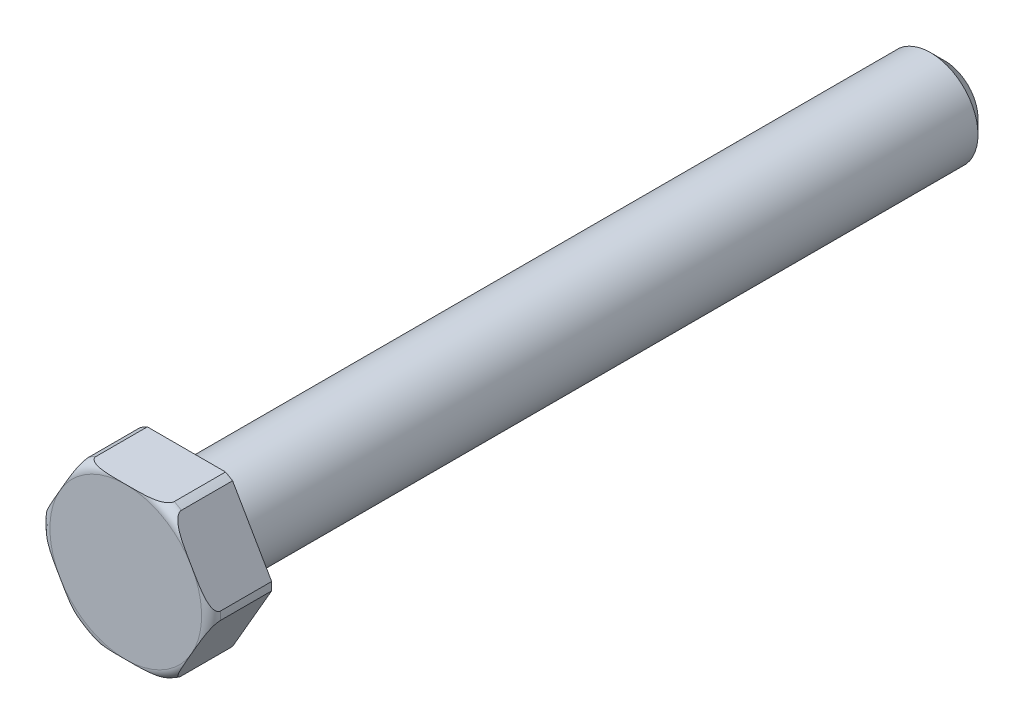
ISO-10303-21;
HEADER;
FILE_DESCRIPTION(('STEP AP214'),'2;1');
FILE_NAME('part.step','',(''),(''),'','','');
FILE_SCHEMA(('AUTOMOTIVE_DESIGN { 1 0 10303 214 1 1 1 1 }'));
ENDSEC;
DATA;
#1=APPLICATION_CONTEXT('core data for automotive mechanical design processes');
#2=APPLICATION_PROTOCOL_DEFINITION('international standard','automotive_design',2000,#1);
#3=PRODUCT_CONTEXT('',#1,'mechanical');
#4=PRODUCT('Part','Part','',(#3));
#5=PRODUCT_RELATED_PRODUCT_CATEGORY('part','',(#4));
#6=PRODUCT_DEFINITION_FORMATION('','',#4);
#7=PRODUCT_DEFINITION_CONTEXT('part definition',#1,'design');
#8=PRODUCT_DEFINITION('design','',#6,#7);
#9=PRODUCT_DEFINITION_SHAPE('','',#8);
#10=(LENGTH_UNIT() NAMED_UNIT(*) SI_UNIT(.MILLI.,.METRE.));
#11=(NAMED_UNIT(*) PLANE_ANGLE_UNIT() SI_UNIT($,.RADIAN.));
#12=(NAMED_UNIT(*) SI_UNIT($,.STERADIAN.) SOLID_ANGLE_UNIT());
#13=UNCERTAINTY_MEASURE_WITH_UNIT(LENGTH_MEASURE(1.E-05),#10,'distance_accuracy_value','');
#14=(GEOMETRIC_REPRESENTATION_CONTEXT(3) GLOBAL_UNCERTAINTY_ASSIGNED_CONTEXT((#13)) GLOBAL_UNIT_ASSIGNED_CONTEXT((#10,
#11,#12)) REPRESENTATION_CONTEXT('',''));
#15=CARTESIAN_POINT('',(0.,0.,0.));
#16=DIRECTION('',(0.,0.,1.));
#17=DIRECTION('',(1.,0.,0.));
#18=AXIS2_PLACEMENT_3D('',#15,#16,#17);
#19=CARTESIAN_POINT('',(0.,0.,0.));
#20=DIRECTION('',(0.,0.,1.));
#21=DIRECTION('',(1.,0.,0.));
#22=AXIS2_PLACEMENT_3D('',#19,#20,#21);
#23=PLANE('',#22);
#24=DIRECTION('',(0.5,0.866025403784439,0.));
#25=VECTOR('',#24,1.);
#26=CARTESIAN_POINT('',(4.61880215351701,-7.99999999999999,0.));
#27=LINE('',#26,#25);
#28=CARTESIAN_POINT('',(4.86665041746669,-7.57071421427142,0.));
#29=VERTEX_POINT('',#28);
#30=CARTESIAN_POINT('',(8.98975604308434,-0.429285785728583,0.));
#31=VERTEX_POINT('',#30);
#32=EDGE_CURVE('E347',#29,#31,#27,.T.);
#33=ORIENTED_EDGE('',*,*,#32,.F.);
#34=CARTESIAN_POINT('',(0.,0.,0.));
#35=DIRECTION('',(0.,0.,1.));
#36=DIRECTION('',(1.,0.,0.));
#37=AXIS2_PLACEMENT_3D('',#34,#35,#36);
#38=CIRCLE('',#37,9.);
#39=CARTESIAN_POINT('',(4.12310562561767,-7.99999999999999,0.));
#40=VERTEX_POINT('',#39);
#41=EDGE_CURVE('E319',#40,#29,#38,.T.);
#42=ORIENTED_EDGE('',*,*,#41,.F.);
#43=DIRECTION('',(1.,0.,0.));
#44=VECTOR('',#43,1.);
#45=CARTESIAN_POINT('',(-4.618802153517,-7.99999999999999,0.));
#46=LINE('',#45,#44);
#47=CARTESIAN_POINT('',(-4.12310562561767,-7.99999999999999,0.));
#48=VERTEX_POINT('',#47);
#49=EDGE_CURVE('E338',#48,#40,#46,.T.);
#50=ORIENTED_EDGE('',*,*,#49,.F.);
#51=CARTESIAN_POINT('',(-4.86665041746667,-7.57071421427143,0.));
#52=VERTEX_POINT('',#51);
#53=EDGE_CURVE('E324',#52,#48,#38,.T.);
#54=ORIENTED_EDGE('',*,*,#53,.F.);
#55=DIRECTION('',(0.5,-0.866025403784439,0.));
#56=VECTOR('',#55,1.);
#57=CARTESIAN_POINT('',(-9.23760430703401,0.,0.));
#58=LINE('',#57,#56);
#59=CARTESIAN_POINT('',(-8.98975604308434,-0.429285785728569,0.));
#60=VERTEX_POINT('',#59);
#61=EDGE_CURVE('E336',#60,#52,#58,.T.);
#62=ORIENTED_EDGE('',*,*,#61,.F.);
#63=CARTESIAN_POINT('',(-8.98975604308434,0.429285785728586,0.));
#64=VERTEX_POINT('',#63);
#65=EDGE_CURVE('E327',#64,#60,#38,.T.);
#66=ORIENTED_EDGE('',*,*,#65,.F.);
#67=DIRECTION('',(-0.5,-0.866025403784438,0.));
#68=VECTOR('',#67,1.);
#69=CARTESIAN_POINT('',(-4.618802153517,8.,0.));
#70=LINE('',#69,#68);
#71=CARTESIAN_POINT('',(-4.86665041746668,7.57071421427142,0.));
#72=VERTEX_POINT('',#71);
#73=EDGE_CURVE('E341',#72,#64,#70,.T.);
#74=ORIENTED_EDGE('',*,*,#73,.F.);
#75=CARTESIAN_POINT('',(-4.12310562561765,8.,0.));
#76=VERTEX_POINT('',#75);
#77=EDGE_CURVE('E325',#76,#72,#38,.T.);
#78=ORIENTED_EDGE('',*,*,#77,.F.);
#79=DIRECTION('',(-1.,0.,0.));
#80=VECTOR('',#79,1.);
#81=CARTESIAN_POINT('',(4.618802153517,8.,0.));
#82=LINE('',#81,#80);
#83=CARTESIAN_POINT('',(4.12310562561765,8.,0.));
#84=VERTEX_POINT('',#83);
#85=EDGE_CURVE('E346',#84,#76,#82,.T.);
#86=ORIENTED_EDGE('',*,*,#85,.F.);
#87=CARTESIAN_POINT('',(4.86665041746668,7.57071421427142,0.));
#88=VERTEX_POINT('',#87);
#89=EDGE_CURVE('E163',#88,#84,#38,.T.);
#90=ORIENTED_EDGE('',*,*,#89,.F.);
#91=DIRECTION('',(-0.5,0.866025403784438,0.));
#92=VECTOR('',#91,1.);
#93=CARTESIAN_POINT('',(9.23760430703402,0.,0.));
#94=LINE('',#93,#92);
#95=CARTESIAN_POINT('',(8.98975604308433,0.429285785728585,0.));
#96=VERTEX_POINT('',#95);
#97=EDGE_CURVE('E345',#96,#88,#94,.T.);
#98=ORIENTED_EDGE('',*,*,#97,.F.);
#99=EDGE_CURVE('E317',#31,#96,#38,.T.);
#100=ORIENTED_EDGE('',*,*,#99,.F.);
#101=EDGE_LOOP('',(#33,#42,#50,#54,#62,#66,#74,#78,#86,#90,#98,#100));
#102=FACE_BOUND('',#101,.T.);
#103=CARTESIAN_POINT('',(0.,0.,0.));
#104=DIRECTION('',(0.,0.,1.));
#105=DIRECTION('',(1.,0.,0.));
#106=AXIS2_PLACEMENT_3D('',#103,#104,#105);
#107=CIRCLE('',#106,5.);
#108=CARTESIAN_POINT('',(5.,0.,0.));
#109=VERTEX_POINT('',#108);
#110=EDGE_CURVE('E223',#109,#109,#107,.F.);
#111=ORIENTED_EDGE('',*,*,#110,.F.);
#112=EDGE_LOOP('',(#111));
#113=FACE_BOUND('',#112,.T.);
#114=ADVANCED_FACE('F24',(#102,#113),#23,.F.);
#115=CARTESIAN_POINT('',(0.,0.,6.4));
#116=DIRECTION('',(0.,0.,-1.));
#117=DIRECTION('',(-1.,0.,0.));
#118=AXIS2_PLACEMENT_3D('',#115,#116,#117);
#119=CYLINDRICAL_SURFACE('',#118,9.);
#120=DIRECTION('',(0.,0.,-1.));
#121=VECTOR('',#120,1.);
#122=CARTESIAN_POINT('',(4.86665041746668,-7.57071421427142,6.4));
#123=LINE('',#122,#121);
#124=CARTESIAN_POINT('',(4.86665041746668,-7.57071421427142,5.4));
#125=VERTEX_POINT('',#124);
#126=EDGE_CURVE('E316',#125,#29,#123,.T.);
#127=ORIENTED_EDGE('',*,*,#126,.F.);
#128=CARTESIAN_POINT('',(0.,0.,5.4));
#129=DIRECTION('',(0.,0.,1.));
#130=DIRECTION('',(1.,0.,0.));
#131=AXIS2_PLACEMENT_3D('',#128,#129,#130);
#132=CIRCLE('',#131,9.);
#133=CARTESIAN_POINT('',(4.12310562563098,-7.99999999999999,5.39999999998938));
#134=VERTEX_POINT('',#133);
#135=EDGE_CURVE('E141',#125,#134,#132,.F.);
#136=ORIENTED_EDGE('',*,*,#135,.T.);
#137=DIRECTION('',(0.,0.,-1.));
#138=VECTOR('',#137,1.);
#139=CARTESIAN_POINT('',(4.12310562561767,-7.99999999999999,6.4));
#140=LINE('',#139,#138);
#141=EDGE_CURVE('E310',#40,#134,#140,.F.);
#142=ORIENTED_EDGE('',*,*,#141,.F.);
#143=ORIENTED_EDGE('',*,*,#41,.T.);
#144=EDGE_LOOP('',(#127,#136,#142,#143));
#145=FACE_BOUND('',#144,.T.);
#146=ADVANCED_FACE('F26',(#145),#119,.T.);
#147=DIRECTION('',(0.,0.,-1.));
#148=VECTOR('',#147,1.);
#149=CARTESIAN_POINT('',(8.98975604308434,-0.429285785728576,6.4));
#150=LINE('',#149,#148);
#151=CARTESIAN_POINT('',(8.98975604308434,-0.429285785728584,5.4));
#152=VERTEX_POINT('',#151);
#153=EDGE_CURVE('E314',#31,#152,#150,.F.);
#154=ORIENTED_EDGE('',*,*,#153,.F.);
#155=ORIENTED_EDGE('',*,*,#99,.T.);
#156=DIRECTION('',(0.,0.,-1.));
#157=VECTOR('',#156,1.);
#158=CARTESIAN_POINT('',(8.98975604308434,0.429285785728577,6.4));
#159=LINE('',#158,#157);
#160=CARTESIAN_POINT('',(8.98975604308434,0.429285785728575,5.4));
#161=VERTEX_POINT('',#160);
#162=EDGE_CURVE('E301',#161,#96,#159,.T.);
#163=ORIENTED_EDGE('',*,*,#162,.F.);
#164=EDGE_CURVE('E152',#161,#152,#132,.F.);
#165=ORIENTED_EDGE('',*,*,#164,.T.);
#166=EDGE_LOOP('',(#154,#155,#163,#165));
#167=FACE_BOUND('',#166,.T.);
#168=ADVANCED_FACE('F245',(#167),#119,.T.);
#169=DIRECTION('',(0.,0.,-1.));
#170=VECTOR('',#169,1.);
#171=CARTESIAN_POINT('',(-4.12310562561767,-7.99999999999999,6.4));
#172=LINE('',#171,#170);
#173=CARTESIAN_POINT('',(-4.12310562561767,-7.99999999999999,5.4));
#174=VERTEX_POINT('',#173);
#175=EDGE_CURVE('E312',#174,#48,#172,.T.);
#176=ORIENTED_EDGE('',*,*,#175,.F.);
#177=CARTESIAN_POINT('',(-4.86665041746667,-7.57071421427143,5.4));
#178=VERTEX_POINT('',#177);
#179=EDGE_CURVE('E273',#174,#178,#132,.F.);
#180=ORIENTED_EDGE('',*,*,#179,.T.);
#181=DIRECTION('',(0.,0.,-1.));
#182=VECTOR('',#181,1.);
#183=CARTESIAN_POINT('',(-4.86665041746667,-7.57071421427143,6.4));
#184=LINE('',#183,#182);
#185=EDGE_CURVE('E306',#52,#178,#184,.F.);
#186=ORIENTED_EDGE('',*,*,#185,.F.);
#187=ORIENTED_EDGE('',*,*,#53,.T.);
#188=EDGE_LOOP('',(#176,#180,#186,#187));
#189=FACE_BOUND('',#188,.T.);
#190=ADVANCED_FACE('F333',(#189),#119,.T.);
#191=DIRECTION('',(0.,0.,-1.));
#192=VECTOR('',#191,1.);
#193=CARTESIAN_POINT('',(-8.98975604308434,-0.429285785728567,6.4));
#194=LINE('',#193,#192);
#195=CARTESIAN_POINT('',(-8.98975604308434,-0.429285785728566,5.4));
#196=VERTEX_POINT('',#195);
#197=EDGE_CURVE('E308',#196,#60,#194,.T.);
#198=ORIENTED_EDGE('',*,*,#197,.F.);
#199=CARTESIAN_POINT('',(-8.98975604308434,0.42928578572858,5.4));
#200=VERTEX_POINT('',#199);
#201=EDGE_CURVE('E275',#196,#200,#132,.F.);
#202=ORIENTED_EDGE('',*,*,#201,.T.);
#203=DIRECTION('',(0.,0.,-1.));
#204=VECTOR('',#203,1.);
#205=CARTESIAN_POINT('',(-8.98975604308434,0.429285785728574,6.4));
#206=LINE('',#205,#204);
#207=EDGE_CURVE('E296',#64,#200,#206,.F.);
#208=ORIENTED_EDGE('',*,*,#207,.F.);
#209=ORIENTED_EDGE('',*,*,#65,.T.);
#210=EDGE_LOOP('',(#198,#202,#208,#209));
#211=FACE_BOUND('',#210,.T.);
#212=ADVANCED_FACE('F355',(#211),#119,.T.);
#213=DIRECTION('',(0.,0.,-1.));
#214=VECTOR('',#213,1.);
#215=CARTESIAN_POINT('',(-4.86665041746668,7.57071421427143,6.4));
#216=LINE('',#215,#214);
#217=CARTESIAN_POINT('',(-4.86665041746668,7.57071421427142,5.4));
#218=VERTEX_POINT('',#217);
#219=EDGE_CURVE('E299',#218,#72,#216,.T.);
#220=ORIENTED_EDGE('',*,*,#219,.F.);
#221=CARTESIAN_POINT('',(-4.12310562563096,8.,5.39999999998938));
#222=VERTEX_POINT('',#221);
#223=EDGE_CURVE('E281',#218,#222,#132,.F.);
#224=ORIENTED_EDGE('',*,*,#223,.T.);
#225=DIRECTION('',(0.,0.,-1.));
#226=VECTOR('',#225,1.);
#227=CARTESIAN_POINT('',(-4.12310562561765,8.,6.4));
#228=LINE('',#227,#226);
#229=EDGE_CURVE('E297',#76,#222,#228,.F.);
#230=ORIENTED_EDGE('',*,*,#229,.F.);
#231=ORIENTED_EDGE('',*,*,#77,.T.);
#232=EDGE_LOOP('',(#220,#224,#230,#231));
#233=FACE_BOUND('',#232,.T.);
#234=ADVANCED_FACE('F267',(#233),#119,.T.);
#235=DIRECTION('',(0.,0.,-1.));
#236=VECTOR('',#235,1.);
#237=CARTESIAN_POINT('',(4.12310562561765,8.,6.4));
#238=LINE('',#237,#236);
#239=CARTESIAN_POINT('',(4.12310562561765,8.,5.4));
#240=VERTEX_POINT('',#239);
#241=EDGE_CURVE('E294',#240,#84,#238,.T.);
#242=ORIENTED_EDGE('',*,*,#241,.F.);
#243=CARTESIAN_POINT('',(4.86665041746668,7.57071421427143,5.4));
#244=VERTEX_POINT('',#243);
#245=EDGE_CURVE('E169',#240,#244,#132,.F.);
#246=ORIENTED_EDGE('',*,*,#245,.T.);
#247=DIRECTION('',(0.,0.,-1.));
#248=VECTOR('',#247,1.);
#249=CARTESIAN_POINT('',(4.86665041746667,7.57071421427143,6.4));
#250=LINE('',#249,#248);
#251=EDGE_CURVE('E136',#88,#244,#250,.F.);
#252=ORIENTED_EDGE('',*,*,#251,.F.);
#253=ORIENTED_EDGE('',*,*,#89,.T.);
#254=EDGE_LOOP('',(#242,#246,#252,#253));
#255=FACE_BOUND('',#254,.T.);
#256=ADVANCED_FACE('F247',(#255),#119,.T.);
#257=CARTESIAN_POINT('',(0.,0.,5.4));
#258=DIRECTION('',(0.,0.,1.));
#259=DIRECTION('',(1.,0.,0.));
#260=AXIS2_PLACEMENT_3D('',#257,#258,#259);
#261=TOROIDAL_SURFACE('',#260,8.,1.);
#262=ORIENTED_EDGE('',*,*,#135,.F.);
#263=CARTESIAN_POINT('',(4.86665043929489,-7.57071417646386,5.3998));
#264=CARTESIAN_POINT('',(4.86660981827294,-7.57078453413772,5.42755718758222));
#265=CARTESIAN_POINT('',(4.86789761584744,-7.56855400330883,5.45523849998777));
#266=CARTESIAN_POINT('',(4.87282590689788,-7.56001795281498,5.50950027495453));
#267=CARTESIAN_POINT('',(4.87644471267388,-7.55374999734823,5.53608850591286));
#268=CARTESIAN_POINT('',(4.8857259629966,-7.53767440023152,5.58766832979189));
#269=CARTESIAN_POINT('',(4.89138194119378,-7.52787795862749,5.61266468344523));
#270=CARTESIAN_POINT('',(4.90436669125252,-7.50538771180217,5.66089802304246));
#271=CARTESIAN_POINT('',(4.91169952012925,-7.49268687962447,5.68413055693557));
#272=CARTESIAN_POINT('',(4.93339220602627,-7.4551140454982,5.74461772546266));
#273=CARTESIAN_POINT('',(4.94903008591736,-7.42802844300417,5.78003456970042));
#274=CARTESIAN_POINT('',(4.98281205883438,-7.36951634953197,5.84569870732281));
#275=CARTESIAN_POINT('',(5.00096326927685,-7.33807753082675,5.87593075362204));
#276=CARTESIAN_POINT('',(5.03704623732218,-7.27557999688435,5.92918638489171));
#277=CARTESIAN_POINT('',(5.05482756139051,-7.24478184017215,5.95262511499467));
#278=CARTESIAN_POINT('',(5.09133266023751,-7.18155315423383,5.99639038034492));
#279=CARTESIAN_POINT('',(5.11005724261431,-7.14912122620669,6.01671418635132));
#280=CARTESIAN_POINT('',(5.14819940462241,-7.08305706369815,6.05471111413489));
#281=CARTESIAN_POINT('',(5.16761809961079,-7.04942289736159,6.07237970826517));
#282=CARTESIAN_POINT('',(5.20692946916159,-6.98133360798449,6.10539348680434));
#283=CARTESIAN_POINT('',(5.22682196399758,-6.94687879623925,6.12073953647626));
#284=CARTESIAN_POINT('',(5.27660054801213,-6.86065975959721,6.15632236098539));
#285=CARTESIAN_POINT('',(5.30669886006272,-6.80852795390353,6.1753693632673));
#286=CARTESIAN_POINT('',(5.36740892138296,-6.70337504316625,6.20988705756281));
#287=CARTESIAN_POINT('',(5.39802093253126,-6.65035348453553,6.22535586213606));
#288=CARTESIAN_POINT('',(5.4904608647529,-6.49024282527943,6.26739788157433));
#289=CARTESIAN_POINT('',(5.55279088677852,-6.38228406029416,6.28953947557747));
#290=CARTESIAN_POINT('',(5.67831693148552,-6.16486657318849,6.3257398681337));
#291=CARTESIAN_POINT('',(5.74151578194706,-6.05540295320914,6.3397556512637));
#292=CARTESIAN_POINT('',(5.86809198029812,-5.8361665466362,6.36203093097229));
#293=CARTESIAN_POINT('',(5.93146908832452,-5.72639417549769,6.37029613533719));
#294=CARTESIAN_POINT('',(6.07692008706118,-5.47446565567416,6.38484509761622));
#295=CARTESIAN_POINT('',(6.15902320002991,-5.33225889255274,6.38983574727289));
#296=CARTESIAN_POINT('',(6.32328016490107,-5.04775748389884,6.39639220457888));
#297=CARTESIAN_POINT('',(6.40543402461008,-4.90546282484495,6.3979568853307));
#298=CARTESIAN_POINT('',(6.56945853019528,-4.62136404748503,6.39969722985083));
#299=CARTESIAN_POINT('',(6.65132916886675,-4.47955994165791,6.3998776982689));
#300=CARTESIAN_POINT('',(6.81506032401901,-4.19596926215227,6.40003202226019));
#301=CARTESIAN_POINT('',(6.89692084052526,-4.05418268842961,6.40000590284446));
#302=CARTESIAN_POINT('',(7.03424362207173,-3.81633265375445,6.39999565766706));
#303=CARTESIAN_POINT('',(7.0897058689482,-3.72026922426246,6.40000070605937));
#304=CARTESIAN_POINT('',(7.20063033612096,-3.52814241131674,6.39986099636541));
#305=CARTESIAN_POINT('',(7.25609255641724,-3.432079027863,6.3997162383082));
#306=CARTESIAN_POINT('',(7.36703779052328,-3.23991624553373,6.39893952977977));
#307=CARTESIAN_POINT('',(7.42252080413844,-3.14381684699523,6.39830739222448));
#308=CARTESIAN_POINT('',(7.53348089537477,-2.95162833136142,6.39602717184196));
#309=CARTESIAN_POINT('',(7.58895797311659,-2.85553921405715,6.3943791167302));
#310=CARTESIAN_POINT('',(7.71925987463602,-2.62984970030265,6.38849186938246));
#311=CARTESIAN_POINT('',(7.794077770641,-2.50026130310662,6.38354894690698));
#312=CARTESIAN_POINT('',(7.94367048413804,-2.24115912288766,6.36824190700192));
#313=CARTESIAN_POINT('',(8.01844519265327,-2.11164552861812,6.35787262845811));
#314=CARTESIAN_POINT('',(8.13205291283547,-1.91487118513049,6.33548124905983));
#315=CARTESIAN_POINT('',(8.17103814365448,-1.84734678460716,6.32659985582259));
#316=CARTESIAN_POINT('',(8.24880645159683,-1.71264812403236,6.3058471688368));
#317=CARTESIAN_POINT('',(8.28758956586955,-1.64547379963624,6.29397644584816));
#318=CARTESIAN_POINT('',(8.36476531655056,-1.51180147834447,6.26652328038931));
#319=CARTESIAN_POINT('',(8.40315849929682,-1.44530253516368,6.25094710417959));
#320=CARTESIAN_POINT('',(8.47938805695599,-1.31326906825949,6.21512704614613));
#321=CARTESIAN_POINT('',(8.51722473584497,-1.2477340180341,6.1948858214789));
#322=CARTESIAN_POINT('',(8.58951912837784,-1.12251645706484,6.15000100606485));
#323=CARTESIAN_POINT('',(8.62403480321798,-1.0627335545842,6.12573716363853));
#324=CARTESIAN_POINT('',(8.69180275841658,-0.945356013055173,6.0705801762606));
#325=CARTESIAN_POINT('',(8.72505379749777,-0.887763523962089,6.0396807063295));
#326=CARTESIAN_POINT('',(8.78380934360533,-0.785995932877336,5.97528918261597));
#327=CARTESIAN_POINT('',(8.8096719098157,-0.741200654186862,5.9431230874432));
#328=CARTESIAN_POINT('',(8.8587186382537,-0.656249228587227,5.87142638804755));
#329=CARTESIAN_POINT('',(8.88191144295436,-0.61607811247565,5.83192069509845));
#330=CARTESIAN_POINT('',(8.91434889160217,-0.559894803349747,5.76369150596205));
#331=CARTESIAN_POINT('',(8.92519671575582,-0.541105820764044,5.73803297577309));
#332=CARTESIAN_POINT('',(8.94495709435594,-0.506879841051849,5.68385427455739));
#333=CARTESIAN_POINT('',(8.95387135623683,-0.491439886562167,5.65533666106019));
#334=CARTESIAN_POINT('',(8.96793607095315,-0.467079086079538,5.60026437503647));
#335=CARTESIAN_POINT('',(8.97345570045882,-0.457518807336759,5.57409024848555));
#336=CARTESIAN_POINT('',(8.98222869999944,-0.442323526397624,5.52028026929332));
#337=CARTESIAN_POINT('',(8.98548758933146,-0.436678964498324,5.49264815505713));
#338=CARTESIAN_POINT('',(8.98823082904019,-0.43192753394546,5.45394005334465));
#339=CARTESIAN_POINT('',(8.98880376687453,-0.430935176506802,5.44314507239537));
#340=CARTESIAN_POINT('',(8.98956758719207,-0.429612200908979,5.42150177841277));
#341=CARTESIAN_POINT('',(8.98975848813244,-0.429281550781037,5.41065346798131));
#342=CARTESIAN_POINT('',(8.98975602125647,-0.429285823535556,5.3998000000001));
#343=B_SPLINE_CURVE_WITH_KNOTS('',3,(#263,#264,#265,#266,#267,#268,#269,#270,#271,#272,#273,
#274,#275,#276,#277,#278,#279,#280,#281,#282,#283,#284,#285,#286,#287,#288,#289,#290,#291,#292,
#293,#294,#295,#296,#297,#298,#299,#300,#301,#302,#303,#304,#305,#306,#307,#308,#309,#310,#311,
#312,#313,#314,#315,#316,#317,#318,#319,#320,#321,#322,#323,#324,#325,#326,#327,#328,#329,#330,
#331,#332,#333,#334,#335,#336,#337,#338,#339,#340,#341,#342),.UNSPECIFIED.,.F.,.F.,(4,2,2,2,2,2,
2,2,2,2,2,2,2,2,2,2,2,2,2,2,2,2,2,2,2,2,2,2,2,2,2,2,2,2,2,2,2,2,2,4),(0.,0.0830288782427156,
0.165296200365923,0.247304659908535,0.329513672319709,0.470444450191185,0.611782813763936,
0.739371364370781,0.867071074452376,0.99498612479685,1.12285340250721,1.31211763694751,
1.50148147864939,1.88084934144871,2.26220753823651,2.64318667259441,3.13595923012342,
3.62889385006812,4.12011669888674,4.61128007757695,4.9440535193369,5.27682689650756,
5.60972807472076,5.94262017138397,6.39172815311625,6.84126406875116,7.07664407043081,
7.31197916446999,7.54691907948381,7.78172550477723,8.00100081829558,8.22048607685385,
8.40278931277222,8.58448473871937,8.68502888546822,8.78548388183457,8.87037323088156,
8.95505459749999,8.9875993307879,9.02014249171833),.UNSPECIFIED.);
#344=CARTESIAN_POINT('',(6.92819559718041,-4.00001322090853,6.4));
#345=VERTEX_POINT('',#344);
#346=EDGE_CURVE('E219',#125,#345,#343,.T.);
#347=ORIENTED_EDGE('',*,*,#346,.T.);
#348=CARTESIAN_POINT('',(0.,0.,6.4));
#349=DIRECTION('',(0.,0.,1.));
#350=DIRECTION('',(1.,0.,0.));
#351=AXIS2_PLACEMENT_3D('',#348,#349,#350);
#352=CIRCLE('',#351,8.);
#353=CARTESIAN_POINT('',(0.,-7.99999999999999,6.4));
#354=VERTEX_POINT('',#353);
#355=EDGE_CURVE('E162',#354,#345,#352,.T.);
#356=ORIENTED_EDGE('',*,*,#355,.F.);
#357=CARTESIAN_POINT('',(0.,-7.99999999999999,6.4000000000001));
#358=CARTESIAN_POINT('',(0.166867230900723,-7.99999999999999,6.4000049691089));
#359=CARTESIAN_POINT('',(0.333734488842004,-7.99999999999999,6.40004229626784));
#360=CARTESIAN_POINT('',(0.667529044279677,-7.99999999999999,6.39971279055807));
#361=CARTESIAN_POINT('',(0.834456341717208,-7.99999999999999,6.39934581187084));
#362=CARTESIAN_POINT('',(1.16792385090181,-7.99999999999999,6.39675595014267));
#363=CARTESIAN_POINT('',(1.33446407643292,-7.99999999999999,6.3945373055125));
#364=CARTESIAN_POINT('',(1.66740044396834,-7.99999999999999,6.38588368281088));
#365=CARTESIAN_POINT('',(1.83379661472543,-7.99999999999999,6.37945002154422));
#366=CARTESIAN_POINT('',(2.15681442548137,-7.99999999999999,6.35956047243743));
#367=CARTESIAN_POINT('',(2.31345723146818,-7.99999999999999,6.34652180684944));
#368=CARTESIAN_POINT('',(2.54767715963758,-7.99999999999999,6.31878065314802));
#369=CARTESIAN_POINT('',(2.62572971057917,-7.99999999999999,6.30815013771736));
#370=CARTESIAN_POINT('',(2.78128535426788,-7.99999999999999,6.28344442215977));
#371=CARTESIAN_POINT('',(2.85878856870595,-7.99999999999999,6.26937001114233));
#372=CARTESIAN_POINT('',(2.99690097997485,-7.99999999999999,6.24027228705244));
#373=CARTESIAN_POINT('',(3.05767791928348,-7.99999999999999,6.22605220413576));
#374=CARTESIAN_POINT('',(3.1783685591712,-7.99999999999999,6.19434472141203));
#375=CARTESIAN_POINT('',(3.23828251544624,-7.99999999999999,6.17685831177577));
#376=CARTESIAN_POINT('',(3.35657368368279,-7.99999999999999,6.13799469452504));
#377=CARTESIAN_POINT('',(3.41495629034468,-7.99999999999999,6.11663412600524));
#378=CARTESIAN_POINT('',(3.52969730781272,-7.99999999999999,6.06909133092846));
#379=CARTESIAN_POINT('',(3.58605805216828,-7.99999999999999,6.04291489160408));
#380=CARTESIAN_POINT('',(3.6794366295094,-7.99999999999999,5.99315222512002));
#381=CARTESIAN_POINT('',(3.71725586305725,-7.99999999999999,5.97107985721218));
#382=CARTESIAN_POINT('',(3.79068495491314,-7.99999999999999,5.92337354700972));
#383=CARTESIAN_POINT('',(3.82629201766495,-7.99999999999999,5.8977352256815));
#384=CARTESIAN_POINT('',(3.89451029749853,-7.99999999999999,5.84206724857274));
#385=CARTESIAN_POINT('',(3.92709026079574,-7.99999999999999,5.81199863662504));
#386=CARTESIAN_POINT('',(3.98712682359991,-7.99999999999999,5.74709412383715));
#387=CARTESIAN_POINT('',(4.01459608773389,-7.99999999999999,5.7122703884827));
#388=CARTESIAN_POINT('',(4.05383540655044,-7.99999999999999,5.65044911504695));
#389=CARTESIAN_POINT('',(4.06776497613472,-7.99999999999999,5.62483093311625));
#390=CARTESIAN_POINT('',(4.09141421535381,-7.99999999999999,5.57170731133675));
#391=CARTESIAN_POINT('',(4.10113795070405,-7.99999999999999,5.5442037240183));
#392=CARTESIAN_POINT('',(4.11560037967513,-7.99999999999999,5.48763844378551));
#393=CARTESIAN_POINT('',(4.12029641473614,-7.99999999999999,5.45856558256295));
#394=CARTESIAN_POINT('',(4.12403882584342,-7.99999999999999,5.40005802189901));
#395=CARTESIAN_POINT('',(4.12308757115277,-7.99999999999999,5.37062347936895));
#396=CARTESIAN_POINT('',(4.1160589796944,-7.99999999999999,5.31562041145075));
#397=CARTESIAN_POINT('',(4.11054449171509,-7.99999999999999,5.28997681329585));
#398=CARTESIAN_POINT('',(4.09558088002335,-7.99999999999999,5.23987532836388));
#399=CARTESIAN_POINT('',(4.0861298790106,-7.99999999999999,5.21541801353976));
#400=CARTESIAN_POINT('',(4.05944846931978,-7.99999999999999,5.15854314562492));
#401=CARTESIAN_POINT('',(4.04061803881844,-7.99999999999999,5.12687924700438));
#402=CARTESIAN_POINT('',(3.99817286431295,-7.99999999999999,5.06694507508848));
#403=CARTESIAN_POINT('',(3.97454667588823,-7.99999999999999,5.03868318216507));
#404=CARTESIAN_POINT('',(3.90845168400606,-7.99999999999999,4.96916368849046));
#405=CARTESIAN_POINT('',(3.86328144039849,-7.99999999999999,4.93049764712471));
#406=CARTESIAN_POINT('',(3.76783287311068,-7.99999999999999,4.86019531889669));
#407=CARTESIAN_POINT('',(3.71754270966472,-7.99999999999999,4.82857589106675));
#408=CARTESIAN_POINT('',(3.61427776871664,-7.99999999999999,4.77125707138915));
#409=CARTESIAN_POINT('',(3.56132788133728,-7.99999999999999,4.74551204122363));
#410=CARTESIAN_POINT('',(3.45343404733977,-7.99999999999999,4.69853944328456));
#411=CARTESIAN_POINT('',(3.39848805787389,-7.99999999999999,4.67731666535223));
#412=CARTESIAN_POINT('',(3.2871972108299,-7.99999999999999,4.63855442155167));
#413=CARTESIAN_POINT('',(3.23084959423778,-7.99999999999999,4.62102299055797));
#414=CARTESIAN_POINT('',(3.11732958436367,-7.99999999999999,4.58907620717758));
#415=CARTESIAN_POINT('',(3.06015772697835,-7.99999999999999,4.57465891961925));
#416=CARTESIAN_POINT('',(2.89283223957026,-7.99999999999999,4.53643386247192));
#417=CARTESIAN_POINT('',(2.78189896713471,-7.99999999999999,4.51604930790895));
#418=CARTESIAN_POINT('',(2.55897583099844,-7.99999999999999,4.48206098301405));
#419=CARTESIAN_POINT('',(2.4469851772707,-7.99999999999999,4.46846277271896));
#420=CARTESIAN_POINT('',(2.22223118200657,-7.99999999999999,4.44617176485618));
#421=CARTESIAN_POINT('',(2.10946657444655,-7.99999999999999,4.43749219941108));
#422=CARTESIAN_POINT('',(1.88371813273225,-7.99999999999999,4.42365660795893));
#423=CARTESIAN_POINT('',(1.77073426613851,-7.99999999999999,4.41850115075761));
#424=CARTESIAN_POINT('',(1.54409252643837,-7.99999999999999,4.41057101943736));
#425=CARTESIAN_POINT('',(1.43043424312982,-7.99999999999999,4.40780905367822));
#426=CARTESIAN_POINT('',(1.20308713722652,-7.99999999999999,4.40381150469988));
#427=CARTESIAN_POINT('',(1.08939831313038,-7.99999999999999,4.40257602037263));
#428=CARTESIAN_POINT('',(0.862208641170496,-7.99999999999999,4.40094265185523));
#429=CARTESIAN_POINT('',(0.748707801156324,-7.99999999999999,4.40054335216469));
#430=CARTESIAN_POINT('',(0.521708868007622,-7.99999999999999,4.4000907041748));
#431=CARTESIAN_POINT('',(0.408210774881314,-7.99999999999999,4.4000373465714));
#432=CARTESIAN_POINT('',(0.18302511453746,-7.99999999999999,4.39999246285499));
#433=CARTESIAN_POINT('',(0.0713375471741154,-7.99999999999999,4.39999996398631));
#434=CARTESIAN_POINT('',(-0.152038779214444,-7.99999999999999,4.40000004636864));
#435=CARTESIAN_POINT('',(-0.263727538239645,-7.99999999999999,4.39999262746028));
#436=CARTESIAN_POINT('',(-0.4872016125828,-7.99999999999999,4.40008491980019));
#437=CARTESIAN_POINT('',(-0.598986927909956,-7.99999999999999,4.40018472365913));
#438=CARTESIAN_POINT('',(-0.822555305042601,-7.99999999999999,4.40080857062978));
#439=CARTESIAN_POINT('',(-0.934338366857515,-7.99999999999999,4.40133260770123));
#440=CARTESIAN_POINT('',(-1.15758983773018,-7.99999999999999,4.40330872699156));
#441=CARTESIAN_POINT('',(-1.26905826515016,-7.99999999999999,4.4047582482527));
#442=CARTESIAN_POINT('',(-1.491961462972,-7.99999999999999,4.40927146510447));
#443=CARTESIAN_POINT('',(-1.60339623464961,-7.99999999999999,4.41233508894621));
#444=CARTESIAN_POINT('',(-1.82606919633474,-7.99999999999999,4.42095899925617));
#445=CARTESIAN_POINT('',(-1.93730747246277,-7.99999999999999,4.42651690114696));
#446=CARTESIAN_POINT('',(-2.15953842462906,-7.99999999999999,4.44124089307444));
#447=CARTESIAN_POINT('',(-2.27053114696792,-7.99999999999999,4.45040623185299));
#448=CARTESIAN_POINT('',(-2.47222763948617,-7.99999999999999,4.47168923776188));
#449=CARTESIAN_POINT('',(-2.56301566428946,-7.99999999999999,4.48298761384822));
#450=CARTESIAN_POINT('',(-2.74401808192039,-7.99999999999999,4.51001545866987));
#451=CARTESIAN_POINT('',(-2.83423202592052,-7.99999999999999,4.52574804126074));
#452=CARTESIAN_POINT('',(-3.01360999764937,-7.99999999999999,4.56299261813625));
#453=CARTESIAN_POINT('',(-3.10277244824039,-7.99999999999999,4.5845123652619));
#454=CARTESIAN_POINT('',(-3.27889987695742,-7.99999999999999,4.63511165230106));
#455=CARTESIAN_POINT('',(-3.36586786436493,-7.99999999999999,4.66418014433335));
#456=CARTESIAN_POINT('',(-3.49389489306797,-7.99999999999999,4.71568659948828));
#457=CARTESIAN_POINT('',(-3.53647337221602,-7.99999999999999,4.73434151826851));
#458=CARTESIAN_POINT('',(-3.62011890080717,-7.99999999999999,4.77475423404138));
#459=CARTESIAN_POINT('',(-3.66118697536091,-7.99999999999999,4.79650987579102));
#460=CARTESIAN_POINT('',(-3.74086953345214,-7.99999999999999,4.84351345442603));
#461=CARTESIAN_POINT('',(-3.77950062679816,-7.99999999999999,4.8687328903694));
#462=CARTESIAN_POINT('',(-3.85358926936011,-7.99999999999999,4.92341655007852));
#463=CARTESIAN_POINT('',(-3.88905358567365,-7.99999999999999,4.95287135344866));
#464=CARTESIAN_POINT('',(-3.94513343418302,-7.99999999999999,5.00696606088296));
#465=CARTESIAN_POINT('',(-3.96697484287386,-7.99999999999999,5.03032686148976));
#466=CARTESIAN_POINT('',(-4.00760812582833,-7.99999999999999,5.07963522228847));
#467=CARTESIAN_POINT('',(-4.02639786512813,-7.99999999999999,5.10558457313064));
#468=CARTESIAN_POINT('',(-4.06005059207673,-7.99999999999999,5.16033754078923));
#469=CARTESIAN_POINT('',(-4.07487099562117,-7.99999999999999,5.18916788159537));
#470=CARTESIAN_POINT('',(-4.09906445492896,-7.99999999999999,5.24903578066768));
#471=CARTESIAN_POINT('',(-4.10844625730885,-7.99999999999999,5.28006970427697));
#472=CARTESIAN_POINT('',(-4.12038735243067,-7.99999999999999,5.34172365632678));
#473=CARTESIAN_POINT('',(-4.12328543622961,-7.99999999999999,5.37227668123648));
#474=CARTESIAN_POINT('',(-4.12290858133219,-7.99999999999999,5.43334300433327));
#475=CARTESIAN_POINT('',(-4.11963491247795,-7.99999999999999,5.46385630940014));
#476=CARTESIAN_POINT('',(-4.10823617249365,-7.99999999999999,5.51924660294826));
#477=CARTESIAN_POINT('',(-4.10089620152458,-7.99999999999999,5.54429207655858));
#478=CARTESIAN_POINT('',(-4.08259371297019,-7.99999999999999,5.59300557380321));
#479=CARTESIAN_POINT('',(-4.07163022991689,-7.99999999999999,5.61667322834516));
#480=CARTESIAN_POINT('',(-4.04027566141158,-7.99999999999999,5.67418236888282));
#481=CARTESIAN_POINT('',(-4.01794046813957,-7.99999999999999,5.70696103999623));
#482=CARTESIAN_POINT('',(-3.9684110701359,-7.99999999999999,5.76861562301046));
#483=CARTESIAN_POINT('',(-3.94120348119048,-7.99999999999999,5.79748038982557));
#484=CARTESIAN_POINT('',(-3.86406492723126,-7.99999999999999,5.86976873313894));
#485=CARTESIAN_POINT('',(-3.81113694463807,-7.99999999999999,5.90996447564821));
#486=CARTESIAN_POINT('',(-3.70013397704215,-7.99999999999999,5.98232178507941));
#487=CARTESIAN_POINT('',(-3.64204719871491,-7.99999999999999,6.01446426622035));
#488=CARTESIAN_POINT('',(-3.52079580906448,-7.99999999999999,6.07341330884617));
#489=CARTESIAN_POINT('',(-3.45752523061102,-7.99999999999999,6.09999808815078));
#490=CARTESIAN_POINT('',(-3.32896918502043,-7.99999999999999,6.14783709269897));
#491=CARTESIAN_POINT('',(-3.26368152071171,-7.99999999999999,6.1690852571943));
#492=CARTESIAN_POINT('',(-3.1317194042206,-7.99999999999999,6.20732918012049));
#493=CARTESIAN_POINT('',(-3.06504194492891,-7.99999999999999,6.22431438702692));
#494=CARTESIAN_POINT('',(-2.930947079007,-7.99999999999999,6.25476316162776));
#495=CARTESIAN_POINT('',(-2.86353016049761,-7.99999999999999,6.26822892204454));
#496=CARTESIAN_POINT('',(-2.68125273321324,-7.99999999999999,6.30065107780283));
#497=CARTESIAN_POINT('',(-2.56592084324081,-7.99999999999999,6.31693694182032));
#498=CARTESIAN_POINT('',(-2.33456370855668,-7.99999999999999,6.34364644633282));
#499=CARTESIAN_POINT('',(-2.21853811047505,-7.99999999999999,6.35406678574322));
#500=CARTESIAN_POINT('',(-1.98597860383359,-7.99999999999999,6.37074944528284));
#501=CARTESIAN_POINT('',(-1.86944414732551,-7.99999999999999,6.3770037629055));
#502=CARTESIAN_POINT('',(-1.63625443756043,-7.99999999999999,6.38664989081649));
#503=CARTESIAN_POINT('',(-1.51959917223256,-7.99999999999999,6.39004138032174));
#504=CARTESIAN_POINT('',(-1.28597540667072,-7.99999999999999,6.39500477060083));
#505=CARTESIAN_POINT('',(-1.16900682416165,-7.99999999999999,6.39657230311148));
#506=CARTESIAN_POINT('',(-0.935057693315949,-7.99999999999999,6.39867805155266));
#507=CARTESIAN_POINT('',(-0.818077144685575,-7.99999999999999,6.39921622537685));
#508=CARTESIAN_POINT('',(-0.584246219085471,-7.99999999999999,6.39984303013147));
#509=CARTESIAN_POINT('',(-0.4673958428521,-7.99999999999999,6.39993216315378));
#510=CARTESIAN_POINT('',(-0.233696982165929,-7.99999999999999,6.40000890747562));
#511=CARTESIAN_POINT('',(-0.116848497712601,-7.99999999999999,6.39999652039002));
#512=CARTESIAN_POINT('',(0.,-7.99999999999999,6.4000000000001));
#513=B_SPLINE_CURVE_WITH_KNOTS('',3,(#357,#358,#359,#360,#361,#362,#363,#364,#365,#366,#367,
#368,#369,#370,#371,#372,#373,#374,#375,#376,#377,#378,#379,#380,#381,#382,#383,#384,#385,#386,
#387,#388,#389,#390,#391,#392,#393,#394,#395,#396,#397,#398,#399,#400,#401,#402,#403,#404,#405,
#406,#407,#408,#409,#410,#411,#412,#413,#414,#415,#416,#417,#418,#419,#420,#421,#422,#423,#424,
#425,#426,#427,#428,#429,#430,#431,#432,#433,#434,#435,#436,#437,#438,#439,#440,#441,#442,#443,
#444,#445,#446,#447,#448,#449,#450,#451,#452,#453,#454,#455,#456,#457,#458,#459,#460,#461,#462,
#463,#464,#465,#466,#467,#468,#469,#470,#471,#472,#473,#474,#475,#476,#477,#478,#479,#480,#481,
#482,#483,#484,#485,#486,#487,#488,#489,#490,#491,#492,#493,#494,#495,#496,#497,#498,#499,#500,
#501,#502,#503,#504,#505,#506,#507,#508,#509,#510,#511,#512),.UNSPECIFIED.,.T.,.F.,(4,2,2,2,2,2,
2,2,2,2,2,2,2,2,2,2,2,2,2,2,2,2,2,2,2,2,2,2,2,2,2,2,2,2,2,2,2,2,2,2,2,2,2,2,2,2,2,2,2,2,2,2,2,2,
2,2,2,2,2,2,2,2,2,2,2,2,2,2,2,2,2,2,2,2,2,2,2,4),(0.,0.500601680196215,1.0013839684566,
1.50102311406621,2.00050624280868,2.47177317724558,2.70803579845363,2.94424433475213,
3.13142771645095,3.31855444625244,3.5048957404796,3.69101455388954,3.82222879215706,
3.95360560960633,4.08621545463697,4.21849217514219,4.30567291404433,4.39276918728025,
4.4805987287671,4.56839142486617,4.64673319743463,4.7251123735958,4.83500848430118,
4.94516999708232,5.12254382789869,5.30033757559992,5.47669906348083,5.65324643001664,
5.83017419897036,6.00699170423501,6.34502328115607,6.68333135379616,7.02254527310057,
7.36181393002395,7.70287310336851,8.04395437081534,8.38445778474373,8.72495204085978,
9.06001474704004,9.39508103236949,9.7304369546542,10.0657881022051,10.4002152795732,
10.7346275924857,11.0687208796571,11.4027446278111,11.6771305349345,11.9517096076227,
12.2266583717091,12.5012069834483,12.6405674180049,12.7798314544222,12.9180115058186,
13.0558888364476,13.1516338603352,13.2474455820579,13.3442473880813,13.4408930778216,
13.5323575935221,13.6238032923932,13.701787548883,13.7797926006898,13.8981076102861,
14.0167527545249,14.2150121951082,14.413737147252,14.6193032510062,14.8251017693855,
15.0314047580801,15.2375789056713,15.5867666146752,15.9361506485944,16.2862038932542,
16.6362963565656,16.9872255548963,17.3381691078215,17.6887201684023,18.0392656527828),.UNSPECIFIED.);
#514=EDGE_CURVE('E39',#354,#134,#513,.T.);
#515=ORIENTED_EDGE('',*,*,#514,.T.);
#516=EDGE_LOOP('',(#262,#347,#356,#515));
#517=FACE_BOUND('',#516,.T.);
#518=ADVANCED_FACE('F194',(#517),#261,.T.);
#519=CARTESIAN_POINT('',(6.9281957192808,4.00001300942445,6.4));
#520=VERTEX_POINT('',#519);
#521=EDGE_CURVE('E149',#345,#520,#352,.T.);
#522=ORIENTED_EDGE('',*,*,#521,.F.);
#523=EDGE_CURVE('E217',#345,#152,#343,.T.);
#524=ORIENTED_EDGE('',*,*,#523,.T.);
#525=ORIENTED_EDGE('',*,*,#164,.F.);
#526=CARTESIAN_POINT('',(8.98975602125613,0.429285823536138,5.3998));
#527=CARTESIAN_POINT('',(8.98979664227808,0.429215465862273,5.42755718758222));
#528=CARTESIAN_POINT('',(8.98850884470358,0.431445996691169,5.45523849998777));
#529=CARTESIAN_POINT('',(8.98358055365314,0.439982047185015,5.50950027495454));
#530=CARTESIAN_POINT('',(8.97996174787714,0.446250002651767,5.53608850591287));
#531=CARTESIAN_POINT('',(8.97068049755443,0.462325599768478,5.58766832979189));
#532=CARTESIAN_POINT('',(8.96502451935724,0.472122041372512,5.61266468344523));
#533=CARTESIAN_POINT('',(8.9520397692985,0.494612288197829,5.66089802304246));
#534=CARTESIAN_POINT('',(8.94470694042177,0.507313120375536,5.68413055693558));
#535=CARTESIAN_POINT('',(8.92301425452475,0.5448859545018,5.74461772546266));
#536=CARTESIAN_POINT('',(8.90737637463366,0.571971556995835,5.78003456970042));
#537=CARTESIAN_POINT('',(8.87359440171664,0.630483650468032,5.84569870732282));
#538=CARTESIAN_POINT('',(8.85544319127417,0.661922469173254,5.87593075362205));
#539=CARTESIAN_POINT('',(8.81936022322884,0.724420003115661,5.92918638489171));
#540=CARTESIAN_POINT('',(8.8015788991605,0.755218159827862,5.95262511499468));
#541=CARTESIAN_POINT('',(8.76507380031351,0.818446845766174,5.99639038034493));
#542=CARTESIAN_POINT('',(8.7463492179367,0.850878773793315,6.01671418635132));
#543=CARTESIAN_POINT('',(8.70820705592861,0.916942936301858,6.0547111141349));
#544=CARTESIAN_POINT('',(8.68878836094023,0.95057710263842,6.07237970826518));
#545=CARTESIAN_POINT('',(8.64947699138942,1.01866639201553,6.10539348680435));
#546=CARTESIAN_POINT('',(8.62958449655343,1.05312120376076,6.12073953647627));
#547=CARTESIAN_POINT('',(8.57980591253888,1.1393402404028,6.1563223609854));
#548=CARTESIAN_POINT('',(8.54970760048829,1.19147204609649,6.17536936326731));
#549=CARTESIAN_POINT('',(8.48899753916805,1.29662495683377,6.20988705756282));
#550=CARTESIAN_POINT('',(8.45838552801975,1.34964651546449,6.22535586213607));
#551=CARTESIAN_POINT('',(8.36594559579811,1.5097571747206,6.26739788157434));
#552=CARTESIAN_POINT('',(8.30361557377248,1.61771593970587,6.28953947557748));
#553=CARTESIAN_POINT('',(8.17808952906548,1.83513342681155,6.32573986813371));
#554=CARTESIAN_POINT('',(8.11489067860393,1.9445970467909,6.33975565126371));
#555=CARTESIAN_POINT('',(7.98831448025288,2.16383345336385,6.3620309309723));
#556=CARTESIAN_POINT('',(7.92493737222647,2.27360582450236,6.37029613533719));
#557=CARTESIAN_POINT('',(7.77948637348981,2.52553434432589,6.38484509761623));
#558=CARTESIAN_POINT('',(7.69738326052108,2.66774110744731,6.38983574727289));
#559=CARTESIAN_POINT('',(7.53312629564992,2.95224251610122,6.39639220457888));
#560=CARTESIAN_POINT('',(7.45097243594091,3.09453717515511,6.3979568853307));
#561=CARTESIAN_POINT('',(7.28694793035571,3.37863595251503,6.39969722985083));
#562=CARTESIAN_POINT('',(7.20507729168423,3.52044005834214,6.3998776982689));
#563=CARTESIAN_POINT('',(7.04134613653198,3.80403073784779,6.40003202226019));
#564=CARTESIAN_POINT('',(6.95948562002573,3.94581731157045,6.40000590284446));
#565=CARTESIAN_POINT('',(6.82216283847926,4.18366734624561,6.39999565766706));
#566=CARTESIAN_POINT('',(6.76670059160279,4.27973077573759,6.40000070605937));
#567=CARTESIAN_POINT('',(6.65577612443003,4.47185758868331,6.39986099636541));
#568=CARTESIAN_POINT('',(6.60031390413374,4.56792097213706,6.3997162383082));
#569=CARTESIAN_POINT('',(6.48936867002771,4.76008375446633,6.39893952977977));
#570=CARTESIAN_POINT('',(6.43388565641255,4.85618315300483,6.39830739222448));
#571=CARTESIAN_POINT('',(6.32292556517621,5.04837166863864,6.39602717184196));
#572=CARTESIAN_POINT('',(6.2674484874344,5.14446078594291,6.3943791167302));
#573=CARTESIAN_POINT('',(6.13714658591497,5.3701502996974,6.38849186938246));
#574=CARTESIAN_POINT('',(6.06232868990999,5.49973869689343,6.38354894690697));
#575=CARTESIAN_POINT('',(5.91273597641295,5.75884087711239,6.36824190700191));
#576=CARTESIAN_POINT('',(5.83796126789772,5.88835447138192,6.35787262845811));
#577=CARTESIAN_POINT('',(5.72435354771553,6.08512881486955,6.33548124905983));
#578=CARTESIAN_POINT('',(5.68536831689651,6.15265321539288,6.32659985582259));
#579=CARTESIAN_POINT('',(5.60760000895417,6.28735187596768,6.30584716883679));
#580=CARTESIAN_POINT('',(5.56881689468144,6.35452620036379,6.29397644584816));
#581=CARTESIAN_POINT('',(5.49164114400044,6.48819852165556,6.2665232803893));
#582=CARTESIAN_POINT('',(5.45324796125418,6.55469746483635,6.25094710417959));
#583=CARTESIAN_POINT('',(5.37701840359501,6.68673093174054,6.21512704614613));
#584=CARTESIAN_POINT('',(5.33918172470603,6.75226598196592,6.19488582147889));
#585=CARTESIAN_POINT('',(5.26688733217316,6.87748354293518,6.15000100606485));
#586=CARTESIAN_POINT('',(5.23237165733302,6.93726644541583,6.12573716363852));
#587=CARTESIAN_POINT('',(5.16460370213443,7.05464398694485,6.0705801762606));
#588=CARTESIAN_POINT('',(5.13135266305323,7.11223647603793,6.03968070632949));
#589=CARTESIAN_POINT('',(5.07259711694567,7.21400406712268,5.97528918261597));
#590=CARTESIAN_POINT('',(5.0467345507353,7.25879934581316,5.9431230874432));
#591=CARTESIAN_POINT('',(4.99768782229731,7.34375077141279,5.87142638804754));
#592=CARTESIAN_POINT('',(4.97449501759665,7.38392188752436,5.83192069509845));
#593=CARTESIAN_POINT('',(4.94205756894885,7.44010519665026,5.76369150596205));
#594=CARTESIAN_POINT('',(4.93120974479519,7.45889417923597,5.73803297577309));
#595=CARTESIAN_POINT('',(4.91144936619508,7.49312015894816,5.68385427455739));
#596=CARTESIAN_POINT('',(4.90253510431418,7.50856011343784,5.65533666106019));
#597=CARTESIAN_POINT('',(4.88847038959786,7.53292091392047,5.60026437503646));
#598=CARTESIAN_POINT('',(4.88295076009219,7.54248119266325,5.57409024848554));
#599=CARTESIAN_POINT('',(4.87417776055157,7.55767647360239,5.52028026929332));
#600=CARTESIAN_POINT('',(4.87091887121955,7.56332103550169,5.49264815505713));
#601=CARTESIAN_POINT('',(4.86817563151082,7.56807246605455,5.45394005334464));
#602=CARTESIAN_POINT('',(4.86760269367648,7.56906482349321,5.44314507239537));
#603=CARTESIAN_POINT('',(4.86683887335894,7.57038779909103,5.42150177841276));
#604=CARTESIAN_POINT('',(4.86664797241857,7.57071844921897,5.41065346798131));
#605=CARTESIAN_POINT('',(4.86665043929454,7.57071417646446,5.3998000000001));
#606=B_SPLINE_CURVE_WITH_KNOTS('',3,(#526,#527,#528,#529,#530,#531,#532,#533,#534,#535,#536,
#537,#538,#539,#540,#541,#542,#543,#544,#545,#546,#547,#548,#549,#550,#551,#552,#553,#554,#555,
#556,#557,#558,#559,#560,#561,#562,#563,#564,#565,#566,#567,#568,#569,#570,#571,#572,#573,#574,
#575,#576,#577,#578,#579,#580,#581,#582,#583,#584,#585,#586,#587,#588,#589,#590,#591,#592,#593,
#594,#595,#596,#597,#598,#599,#600,#601,#602,#603,#604,#605),.UNSPECIFIED.,.F.,.F.,(4,2,2,2,2,2,
2,2,2,2,2,2,2,2,2,2,2,2,2,2,2,2,2,2,2,2,2,2,2,2,2,2,2,2,2,2,2,2,2,4),(0.,0.0830288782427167,
0.165296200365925,0.247304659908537,0.329513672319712,0.470444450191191,0.611782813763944,
0.739371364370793,0.867071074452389,0.994986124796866,1.12285340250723,1.31211763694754,
1.50148147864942,1.88084934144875,2.26220753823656,2.64318667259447,3.13595923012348,
3.62889385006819,4.1201166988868,4.61128007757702,4.94405351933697,5.27682689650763,
5.60972807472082,5.94262017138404,6.3917281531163,6.8412640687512,7.07664407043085,
7.31197916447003,7.54691907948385,7.78172550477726,8.00100081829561,8.22048607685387,
8.40278931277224,8.58448473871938,8.68502888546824,8.78548388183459,8.87037323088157,
8.9550545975,8.98759933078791,9.02014249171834),.UNSPECIFIED.);
#607=EDGE_CURVE('E133',#161,#520,#606,.T.);
#608=ORIENTED_EDGE('',*,*,#607,.T.);
#609=EDGE_LOOP('',(#522,#524,#525,#608));
#610=FACE_BOUND('',#609,.T.);
#611=ADVANCED_FACE('F147',(#610),#261,.T.);
#612=ORIENTED_EDGE('',*,*,#179,.F.);
#613=EDGE_CURVE('E366',#174,#354,#513,.T.);
#614=ORIENTED_EDGE('',*,*,#613,.T.);
#615=CARTESIAN_POINT('',(-6.92819839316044,-4.00000837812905,6.4));
#616=VERTEX_POINT('',#615);
#617=EDGE_CURVE('E183',#616,#354,#352,.T.);
#618=ORIENTED_EDGE('',*,*,#617,.F.);
#619=CARTESIAN_POINT('',(-8.98975602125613,-0.429285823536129,5.3998));
#620=CARTESIAN_POINT('',(-8.98979664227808,-0.429215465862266,5.42755718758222));
#621=CARTESIAN_POINT('',(-8.98850884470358,-0.431445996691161,5.45523849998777));
#622=CARTESIAN_POINT('',(-8.98358055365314,-0.439982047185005,5.50950027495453));
#623=CARTESIAN_POINT('',(-8.97996174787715,-0.446250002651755,5.53608850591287));
#624=CARTESIAN_POINT('',(-8.97068049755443,-0.462325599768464,5.58766832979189));
#625=CARTESIAN_POINT('',(-8.96502451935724,-0.472122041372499,5.61266468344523));
#626=CARTESIAN_POINT('',(-8.9520397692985,-0.494612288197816,5.66089802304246));
#627=CARTESIAN_POINT('',(-8.94470694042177,-0.507313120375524,5.68413055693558));
#628=CARTESIAN_POINT('',(-8.92301425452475,-0.544885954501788,5.74461772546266));
#629=CARTESIAN_POINT('',(-8.90737637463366,-0.571971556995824,5.78003456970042));
#630=CARTESIAN_POINT('',(-8.87359440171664,-0.630483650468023,5.84569870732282));
#631=CARTESIAN_POINT('',(-8.85544319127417,-0.661922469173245,5.87593075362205));
#632=CARTESIAN_POINT('',(-8.81936022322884,-0.724420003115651,5.92918638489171));
#633=CARTESIAN_POINT('',(-8.8015788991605,-0.755218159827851,5.95262511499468));
#634=CARTESIAN_POINT('',(-8.76507380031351,-0.818446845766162,5.99639038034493));
#635=CARTESIAN_POINT('',(-8.74634921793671,-0.850878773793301,6.01671418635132));
#636=CARTESIAN_POINT('',(-8.70820705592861,-0.916942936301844,6.05471111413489));
#637=CARTESIAN_POINT('',(-8.68878836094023,-0.950577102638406,6.07237970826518));
#638=CARTESIAN_POINT('',(-8.64947699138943,-1.01866639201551,6.10539348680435));
#639=CARTESIAN_POINT('',(-8.62958449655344,-1.05312120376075,6.12073953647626));
#640=CARTESIAN_POINT('',(-8.57980591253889,-1.13934024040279,6.1563223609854));
#641=CARTESIAN_POINT('',(-8.54970760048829,-1.19147204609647,6.17536936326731));
#642=CARTESIAN_POINT('',(-8.48899753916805,-1.29662495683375,6.20988705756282));
#643=CARTESIAN_POINT('',(-8.45838552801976,-1.34964651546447,6.22535586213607));
#644=CARTESIAN_POINT('',(-8.36594559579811,-1.50975717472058,6.26739788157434));
#645=CARTESIAN_POINT('',(-8.30361557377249,-1.61771593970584,6.28953947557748));
#646=CARTESIAN_POINT('',(-8.17808952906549,-1.83513342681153,6.32573986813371));
#647=CARTESIAN_POINT('',(-8.11489067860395,-1.94459704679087,6.33975565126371));
#648=CARTESIAN_POINT('',(-7.98831448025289,-2.16383345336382,6.3620309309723));
#649=CARTESIAN_POINT('',(-7.92493737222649,-2.27360582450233,6.37029613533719));
#650=CARTESIAN_POINT('',(-7.77948637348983,-2.52553434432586,6.38484509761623));
#651=CARTESIAN_POINT('',(-7.69738326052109,-2.66774110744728,6.38983574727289));
#652=CARTESIAN_POINT('',(-7.53312629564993,-2.95224251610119,6.39639220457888));
#653=CARTESIAN_POINT('',(-7.45097243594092,-3.09453717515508,6.3979568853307));
#654=CARTESIAN_POINT('',(-7.28694793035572,-3.378635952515,6.39969722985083));
#655=CARTESIAN_POINT('',(-7.20507729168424,-3.52044005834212,6.3998776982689));
#656=CARTESIAN_POINT('',(-7.04134613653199,-3.80403073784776,6.40003202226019));
#657=CARTESIAN_POINT('',(-6.95948562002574,-3.94581731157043,6.40000590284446));
#658=CARTESIAN_POINT('',(-6.82216283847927,-4.18366734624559,6.39999565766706));
#659=CARTESIAN_POINT('',(-6.76670059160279,-4.27973077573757,6.40000070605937));
#660=CARTESIAN_POINT('',(-6.65577612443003,-4.4718575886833,6.39986099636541));
#661=CARTESIAN_POINT('',(-6.60031390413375,-4.56792097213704,6.3997162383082));
#662=CARTESIAN_POINT('',(-6.48936867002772,-4.76008375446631,6.39893952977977));
#663=CARTESIAN_POINT('',(-6.43388565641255,-4.85618315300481,6.39830739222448));
#664=CARTESIAN_POINT('',(-6.32292556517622,-5.04837166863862,6.39602717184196));
#665=CARTESIAN_POINT('',(-6.2674484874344,-5.14446078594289,6.3943791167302));
#666=CARTESIAN_POINT('',(-6.13714658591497,-5.37015029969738,6.38849186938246));
#667=CARTESIAN_POINT('',(-6.06232868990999,-5.49973869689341,6.38354894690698));
#668=CARTESIAN_POINT('',(-5.91273597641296,-5.75884087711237,6.36824190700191));
#669=CARTESIAN_POINT('',(-5.83796126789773,-5.88835447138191,6.35787262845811));
#670=CARTESIAN_POINT('',(-5.72435354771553,-6.08512881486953,6.33548124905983));
#671=CARTESIAN_POINT('',(-5.68536831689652,-6.15265321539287,6.3265998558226));
#672=CARTESIAN_POINT('',(-5.60760000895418,-6.28735187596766,6.3058471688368));
#673=CARTESIAN_POINT('',(-5.56881689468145,-6.35452620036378,6.29397644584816));
#674=CARTESIAN_POINT('',(-5.49164114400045,-6.48819852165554,6.26652328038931));
#675=CARTESIAN_POINT('',(-5.45324796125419,-6.55469746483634,6.25094710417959));
#676=CARTESIAN_POINT('',(-5.37701840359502,-6.68673093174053,6.21512704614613));
#677=CARTESIAN_POINT('',(-5.33918172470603,-6.75226598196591,6.1948858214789));
#678=CARTESIAN_POINT('',(-5.26688733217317,-6.87748354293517,6.15000100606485));
#679=CARTESIAN_POINT('',(-5.23237165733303,-6.93726644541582,6.12573716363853));
#680=CARTESIAN_POINT('',(-5.16460370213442,-7.05464398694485,6.0705801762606));
#681=CARTESIAN_POINT('',(-5.13135266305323,-7.11223647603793,6.0396807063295));
#682=CARTESIAN_POINT('',(-5.07259711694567,-7.21400406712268,5.97528918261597));
#683=CARTESIAN_POINT('',(-5.0467345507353,-7.25879934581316,5.9431230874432));
#684=CARTESIAN_POINT('',(-4.99768782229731,-7.34375077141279,5.87142638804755));
#685=CARTESIAN_POINT('',(-4.97449501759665,-7.38392188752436,5.83192069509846));
#686=CARTESIAN_POINT('',(-4.94205756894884,-7.44010519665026,5.76369150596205));
#687=CARTESIAN_POINT('',(-4.93120974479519,-7.45889417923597,5.73803297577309));
#688=CARTESIAN_POINT('',(-4.91144936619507,-7.49312015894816,5.68385427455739));
#689=CARTESIAN_POINT('',(-4.90253510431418,-7.50856011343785,5.65533666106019));
#690=CARTESIAN_POINT('',(-4.88847038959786,-7.53292091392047,5.60026437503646));
#691=CARTESIAN_POINT('',(-4.88295076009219,-7.54248119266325,5.57409024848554));
#692=CARTESIAN_POINT('',(-4.87417776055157,-7.55767647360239,5.52028026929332));
#693=CARTESIAN_POINT('',(-4.87091887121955,-7.56332103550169,5.49264815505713));
#694=CARTESIAN_POINT('',(-4.86817563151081,-7.56807246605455,5.45394005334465));
#695=CARTESIAN_POINT('',(-4.86760269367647,-7.56906482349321,5.44314507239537));
#696=CARTESIAN_POINT('',(-4.86683887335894,-7.57038779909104,5.42150177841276));
#697=CARTESIAN_POINT('',(-4.86664797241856,-7.57071844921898,5.41065346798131));
#698=CARTESIAN_POINT('',(-4.86665043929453,-7.57071417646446,5.3998000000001));
#699=B_SPLINE_CURVE_WITH_KNOTS('',3,(#619,#620,#621,#622,#623,#624,#625,#626,#627,#628,#629,
#630,#631,#632,#633,#634,#635,#636,#637,#638,#639,#640,#641,#642,#643,#644,#645,#646,#647,#648,
#649,#650,#651,#652,#653,#654,#655,#656,#657,#658,#659,#660,#661,#662,#663,#664,#665,#666,#667,
#668,#669,#670,#671,#672,#673,#674,#675,#676,#677,#678,#679,#680,#681,#682,#683,#684,#685,#686,
#687,#688,#689,#690,#691,#692,#693,#694,#695,#696,#697,#698),.UNSPECIFIED.,.F.,.F.,(4,2,2,2,2,2,
2,2,2,2,2,2,2,2,2,2,2,2,2,2,2,2,2,2,2,2,2,2,2,2,2,2,2,2,2,2,2,2,2,4),(0.,0.0830288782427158,
0.165296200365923,0.247304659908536,0.329513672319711,0.47044445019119,0.611782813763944,
0.73937136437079,0.867071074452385,0.994986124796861,1.12285340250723,1.31211763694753,
1.50148147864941,1.88084934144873,2.26220753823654,2.64318667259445,3.13595923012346,
3.62889385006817,4.12011669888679,4.61128007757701,4.94405351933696,5.27682689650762,
5.60972807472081,5.94262017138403,6.3917281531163,6.8412640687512,7.07664407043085,
7.31197916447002,7.54691907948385,7.78172550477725,8.00100081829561,8.22048607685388,
8.40278931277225,8.58448473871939,8.68502888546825,8.7854838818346,8.87037323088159,
8.95505459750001,8.98759933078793,9.02014249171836),.UNSPECIFIED.);
#700=EDGE_CURVE('E387',#616,#178,#699,.T.);
#701=ORIENTED_EDGE('',*,*,#700,.T.);
#702=EDGE_LOOP('',(#612,#614,#618,#701));
#703=FACE_BOUND('',#702,.T.);
#704=ADVANCED_FACE('F266',(#703),#261,.T.);
#705=ORIENTED_EDGE('',*,*,#201,.F.);
#706=EDGE_CURVE('E367',#196,#616,#699,.T.);
#707=ORIENTED_EDGE('',*,*,#706,.T.);
#708=CARTESIAN_POINT('',(-6.92821163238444,3.99998544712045,6.4));
#709=VERTEX_POINT('',#708);
#710=EDGE_CURVE('E171',#709,#616,#352,.T.);
#711=ORIENTED_EDGE('',*,*,#710,.F.);
#712=CARTESIAN_POINT('',(-4.86665043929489,7.57071417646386,5.3998));
#713=CARTESIAN_POINT('',(-4.86660981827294,7.57078453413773,5.42755718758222));
#714=CARTESIAN_POINT('',(-4.86789761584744,7.56855400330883,5.45523849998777));
#715=CARTESIAN_POINT('',(-4.87282590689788,7.56001795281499,5.50950027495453));
#716=CARTESIAN_POINT('',(-4.87644471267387,7.55374999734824,5.53608850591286));
#717=CARTESIAN_POINT('',(-4.88572596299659,7.53767440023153,5.58766832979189));
#718=CARTESIAN_POINT('',(-4.89138194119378,7.52787795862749,5.61266468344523));
#719=CARTESIAN_POINT('',(-4.90436669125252,7.50538771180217,5.66089802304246));
#720=CARTESIAN_POINT('',(-4.91169952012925,7.49268687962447,5.68413055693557));
#721=CARTESIAN_POINT('',(-4.93339220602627,7.4551140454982,5.74461772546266));
#722=CARTESIAN_POINT('',(-4.94903008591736,7.42802844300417,5.78003456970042));
#723=CARTESIAN_POINT('',(-4.98281205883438,7.36951634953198,5.84569870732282));
#724=CARTESIAN_POINT('',(-5.00096326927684,7.33807753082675,5.87593075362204));
#725=CARTESIAN_POINT('',(-5.03704623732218,7.27557999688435,5.92918638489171));
#726=CARTESIAN_POINT('',(-5.05482756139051,7.24478184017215,5.95262511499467));
#727=CARTESIAN_POINT('',(-5.0913326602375,7.18155315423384,5.99639038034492));
#728=CARTESIAN_POINT('',(-5.11005724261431,7.1491212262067,6.01671418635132));
#729=CARTESIAN_POINT('',(-5.1481994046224,7.08305706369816,6.05471111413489));
#730=CARTESIAN_POINT('',(-5.16761809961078,7.0494228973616,6.07237970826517));
#731=CARTESIAN_POINT('',(-5.20692946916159,6.98133360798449,6.10539348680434));
#732=CARTESIAN_POINT('',(-5.22682196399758,6.94687879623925,6.12073953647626));
#733=CARTESIAN_POINT('',(-5.27660054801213,6.86065975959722,6.15632236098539));
#734=CARTESIAN_POINT('',(-5.30669886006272,6.80852795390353,6.1753693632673));
#735=CARTESIAN_POINT('',(-5.36740892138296,6.70337504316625,6.20988705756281));
#736=CARTESIAN_POINT('',(-5.39802093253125,6.65035348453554,6.22535586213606));
#737=CARTESIAN_POINT('',(-5.49046086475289,6.49024282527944,6.26739788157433));
#738=CARTESIAN_POINT('',(-5.55279088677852,6.38228406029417,6.28953947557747));
#739=CARTESIAN_POINT('',(-5.67831693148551,6.16486657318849,6.3257398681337));
#740=CARTESIAN_POINT('',(-5.74151578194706,6.05540295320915,6.3397556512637));
#741=CARTESIAN_POINT('',(-5.86809198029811,5.8361665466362,6.36203093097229));
#742=CARTESIAN_POINT('',(-5.93146908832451,5.7263941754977,6.37029613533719));
#743=CARTESIAN_POINT('',(-6.07692008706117,5.47446565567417,6.38484509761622));
#744=CARTESIAN_POINT('',(-6.1590232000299,5.33225889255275,6.38983574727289));
#745=CARTESIAN_POINT('',(-6.32328016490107,5.04775748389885,6.39639220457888));
#746=CARTESIAN_POINT('',(-6.40543402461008,4.90546282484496,6.3979568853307));
#747=CARTESIAN_POINT('',(-6.56945853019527,4.62136404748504,6.39969722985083));
#748=CARTESIAN_POINT('',(-6.65132916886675,4.47955994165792,6.3998776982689));
#749=CARTESIAN_POINT('',(-6.815060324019,4.19596926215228,6.40003202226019));
#750=CARTESIAN_POINT('',(-6.89692084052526,4.05418268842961,6.40000590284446));
#751=CARTESIAN_POINT('',(-7.03424362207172,3.81633265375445,6.39999565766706));
#752=CARTESIAN_POINT('',(-7.0897058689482,3.72026922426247,6.40000070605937));
#753=CARTESIAN_POINT('',(-7.20063033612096,3.52814241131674,6.39986099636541));
#754=CARTESIAN_POINT('',(-7.25609255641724,3.432079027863,6.3997162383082));
#755=CARTESIAN_POINT('',(-7.36703779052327,3.23991624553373,6.39893952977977));
#756=CARTESIAN_POINT('',(-7.42252080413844,3.14381684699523,6.39830739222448));
#757=CARTESIAN_POINT('',(-7.53348089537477,2.95162833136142,6.39602717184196));
#758=CARTESIAN_POINT('',(-7.58895797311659,2.85553921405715,6.3943791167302));
#759=CARTESIAN_POINT('',(-7.71925987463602,2.62984970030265,6.38849186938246));
#760=CARTESIAN_POINT('',(-7.794077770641,2.50026130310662,6.38354894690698));
#761=CARTESIAN_POINT('',(-7.94367048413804,2.24115912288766,6.36824190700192));
#762=CARTESIAN_POINT('',(-8.01844519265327,2.11164552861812,6.35787262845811));
#763=CARTESIAN_POINT('',(-8.13205291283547,1.91487118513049,6.33548124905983));
#764=CARTESIAN_POINT('',(-8.17103814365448,1.84734678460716,6.3265998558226));
#765=CARTESIAN_POINT('',(-8.24880645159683,1.71264812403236,6.3058471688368));
#766=CARTESIAN_POINT('',(-8.28758956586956,1.64547379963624,6.29397644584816));
#767=CARTESIAN_POINT('',(-8.36476531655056,1.51180147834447,6.26652328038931));
#768=CARTESIAN_POINT('',(-8.40315849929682,1.44530253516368,6.25094710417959));
#769=CARTESIAN_POINT('',(-8.47938805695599,1.31326906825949,6.21512704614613));
#770=CARTESIAN_POINT('',(-8.51722473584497,1.2477340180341,6.1948858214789));
#771=CARTESIAN_POINT('',(-8.58951912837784,1.12251645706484,6.15000100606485));
#772=CARTESIAN_POINT('',(-8.62403480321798,1.0627335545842,6.12573716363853));
#773=CARTESIAN_POINT('',(-8.69180275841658,0.945356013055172,6.0705801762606));
#774=CARTESIAN_POINT('',(-8.72505379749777,0.887763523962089,6.0396807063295));
#775=CARTESIAN_POINT('',(-8.78380934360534,0.785995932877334,5.97528918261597));
#776=CARTESIAN_POINT('',(-8.80967190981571,0.74120065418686,5.9431230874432));
#777=CARTESIAN_POINT('',(-8.8587186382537,0.656249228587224,5.87142638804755));
#778=CARTESIAN_POINT('',(-8.88191144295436,0.616078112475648,5.83192069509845));
#779=CARTESIAN_POINT('',(-8.91434889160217,0.559894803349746,5.76369150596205));
#780=CARTESIAN_POINT('',(-8.92519671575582,0.541105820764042,5.73803297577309));
#781=CARTESIAN_POINT('',(-8.94495709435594,0.506879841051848,5.68385427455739));
#782=CARTESIAN_POINT('',(-8.95387135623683,0.491439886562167,5.65533666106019));
#783=CARTESIAN_POINT('',(-8.96793607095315,0.467079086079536,5.60026437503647));
#784=CARTESIAN_POINT('',(-8.97345570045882,0.457518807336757,5.57409024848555));
#785=CARTESIAN_POINT('',(-8.98222869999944,0.442323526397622,5.52028026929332));
#786=CARTESIAN_POINT('',(-8.98548758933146,0.436678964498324,5.49264815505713));
#787=CARTESIAN_POINT('',(-8.98823082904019,0.431927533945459,5.45394005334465));
#788=CARTESIAN_POINT('',(-8.98880376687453,0.4309351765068,5.44314507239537));
#789=CARTESIAN_POINT('',(-8.98956758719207,0.429612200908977,5.42150177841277));
#790=CARTESIAN_POINT('',(-8.98975848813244,0.429281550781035,5.41065346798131));
#791=CARTESIAN_POINT('',(-8.98975602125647,0.429285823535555,5.3998000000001));
#792=B_SPLINE_CURVE_WITH_KNOTS('',3,(#712,#713,#714,#715,#716,#717,#718,#719,#720,#721,#722,
#723,#724,#725,#726,#727,#728,#729,#730,#731,#732,#733,#734,#735,#736,#737,#738,#739,#740,#741,
#742,#743,#744,#745,#746,#747,#748,#749,#750,#751,#752,#753,#754,#755,#756,#757,#758,#759,#760,
#761,#762,#763,#764,#765,#766,#767,#768,#769,#770,#771,#772,#773,#774,#775,#776,#777,#778,#779,
#780,#781,#782,#783,#784,#785,#786,#787,#788,#789,#790,#791),.UNSPECIFIED.,.F.,.F.,(4,2,2,2,2,2,
2,2,2,2,2,2,2,2,2,2,2,2,2,2,2,2,2,2,2,2,2,2,2,2,2,2,2,2,2,2,2,2,2,4),(0.,0.0830288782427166,
0.165296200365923,0.247304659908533,0.329513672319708,0.470444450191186,0.611782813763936,
0.73937136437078,0.867071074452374,0.99498612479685,1.12285340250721,1.31211763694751,
1.50148147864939,1.88084934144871,2.2622075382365,2.64318667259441,3.13595923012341,
3.62889385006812,4.12011669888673,4.61128007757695,4.9440535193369,5.27682689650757,
5.60972807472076,5.94262017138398,6.39172815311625,6.84126406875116,7.07664407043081,
7.31197916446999,7.54691907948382,7.78172550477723,8.00100081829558,8.22048607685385,
8.40278931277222,8.58448473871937,8.68502888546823,8.78548388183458,8.87037323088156,
8.95505459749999,8.9875993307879,9.02014249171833),.UNSPECIFIED.);
#793=EDGE_CURVE('E394',#709,#200,#792,.T.);
#794=ORIENTED_EDGE('',*,*,#793,.T.);
#795=EDGE_LOOP('',(#705,#707,#711,#794));
#796=FACE_BOUND('',#795,.T.);
#797=ADVANCED_FACE('F258',(#796),#261,.T.);
#798=ORIENTED_EDGE('',*,*,#223,.F.);
#799=EDGE_CURVE('E391',#218,#709,#792,.T.);
#800=ORIENTED_EDGE('',*,*,#799,.T.);
#801=CARTESIAN_POINT('',(0.,8.,6.4));
#802=VERTEX_POINT('',#801);
#803=EDGE_CURVE('E167',#802,#709,#352,.T.);
#804=ORIENTED_EDGE('',*,*,#803,.F.);
#805=CARTESIAN_POINT('',(0.,8.,6.4000000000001));
#806=CARTESIAN_POINT('',(-0.166867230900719,8.,6.4000049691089));
#807=CARTESIAN_POINT('',(-0.333734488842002,8.,6.40004229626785));
#808=CARTESIAN_POINT('',(-0.667529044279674,8.,6.39971279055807));
#809=CARTESIAN_POINT('',(-0.834456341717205,8.,6.39934581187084));
#810=CARTESIAN_POINT('',(-1.16792385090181,8.,6.39675595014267));
#811=CARTESIAN_POINT('',(-1.33446407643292,8.,6.3945373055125));
#812=CARTESIAN_POINT('',(-1.66740044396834,8.,6.38588368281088));
#813=CARTESIAN_POINT('',(-1.83379661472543,8.,6.37945002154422));
#814=CARTESIAN_POINT('',(-2.15681442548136,8.,6.35956047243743));
#815=CARTESIAN_POINT('',(-2.31345723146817,8.,6.34652180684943));
#816=CARTESIAN_POINT('',(-2.54767715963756,8.,6.31878065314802));
#817=CARTESIAN_POINT('',(-2.62572971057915,8.,6.30815013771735));
#818=CARTESIAN_POINT('',(-2.78128535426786,8.,6.28344442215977));
#819=CARTESIAN_POINT('',(-2.85878856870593,8.,6.26937001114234));
#820=CARTESIAN_POINT('',(-2.99690097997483,8.,6.24027228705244));
#821=CARTESIAN_POINT('',(-3.05767791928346,8.,6.22605220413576));
#822=CARTESIAN_POINT('',(-3.17836855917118,8.,6.19434472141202));
#823=CARTESIAN_POINT('',(-3.23828251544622,8.,6.17685831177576));
#824=CARTESIAN_POINT('',(-3.35657368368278,8.,6.13799469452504));
#825=CARTESIAN_POINT('',(-3.41495629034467,8.,6.11663412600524));
#826=CARTESIAN_POINT('',(-3.52969730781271,8.,6.06909133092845));
#827=CARTESIAN_POINT('',(-3.58605805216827,8.,6.04291489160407));
#828=CARTESIAN_POINT('',(-3.67943662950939,8.,5.99315222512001));
#829=CARTESIAN_POINT('',(-3.71725586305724,8.,5.97107985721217));
#830=CARTESIAN_POINT('',(-3.79068495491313,8.,5.92337354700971));
#831=CARTESIAN_POINT('',(-3.82629201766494,8.,5.8977352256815));
#832=CARTESIAN_POINT('',(-3.89451029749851,8.,5.84206724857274));
#833=CARTESIAN_POINT('',(-3.92709026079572,8.,5.81199863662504));
#834=CARTESIAN_POINT('',(-3.98712682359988,8.,5.74709412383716));
#835=CARTESIAN_POINT('',(-4.01459608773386,8.,5.71227038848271));
#836=CARTESIAN_POINT('',(-4.05383540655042,8.,5.65044911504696));
#837=CARTESIAN_POINT('',(-4.0677649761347,8.,5.62483093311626));
#838=CARTESIAN_POINT('',(-4.09141421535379,8.,5.57170731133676));
#839=CARTESIAN_POINT('',(-4.10113795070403,8.,5.5442037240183));
#840=CARTESIAN_POINT('',(-4.11560037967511,8.,5.48763844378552));
#841=CARTESIAN_POINT('',(-4.12029641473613,8.,5.45856558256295));
#842=CARTESIAN_POINT('',(-4.1240388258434,8.,5.40005802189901));
#843=CARTESIAN_POINT('',(-4.12308757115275,8.,5.37062347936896));
#844=CARTESIAN_POINT('',(-4.11605897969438,8.,5.31562041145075));
#845=CARTESIAN_POINT('',(-4.11054449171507,8.,5.28997681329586));
#846=CARTESIAN_POINT('',(-4.09558088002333,8.,5.23987532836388));
#847=CARTESIAN_POINT('',(-4.08612987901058,8.,5.21541801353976));
#848=CARTESIAN_POINT('',(-4.05944846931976,8.,5.15854314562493));
#849=CARTESIAN_POINT('',(-4.04061803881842,8.,5.12687924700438));
#850=CARTESIAN_POINT('',(-3.99817286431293,8.,5.06694507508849));
#851=CARTESIAN_POINT('',(-3.97454667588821,8.,5.03868318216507));
#852=CARTESIAN_POINT('',(-3.90845168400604,8.,4.96916368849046));
#853=CARTESIAN_POINT('',(-3.86328144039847,8.,4.93049764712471));
#854=CARTESIAN_POINT('',(-3.76783287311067,8.,4.86019531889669));
#855=CARTESIAN_POINT('',(-3.71754270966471,8.,4.82857589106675));
#856=CARTESIAN_POINT('',(-3.61427776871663,8.,4.77125707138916));
#857=CARTESIAN_POINT('',(-3.56132788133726,8.,4.74551204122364));
#858=CARTESIAN_POINT('',(-3.45343404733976,8.,4.69853944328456));
#859=CARTESIAN_POINT('',(-3.39848805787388,8.,4.67731666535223));
#860=CARTESIAN_POINT('',(-3.28719721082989,8.,4.63855442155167));
#861=CARTESIAN_POINT('',(-3.23084959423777,8.,4.62102299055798));
#862=CARTESIAN_POINT('',(-3.11732958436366,8.,4.58907620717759));
#863=CARTESIAN_POINT('',(-3.06015772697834,8.,4.57465891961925));
#864=CARTESIAN_POINT('',(-2.89283223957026,8.,4.53643386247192));
#865=CARTESIAN_POINT('',(-2.7818989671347,8.,4.51604930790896));
#866=CARTESIAN_POINT('',(-2.55897583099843,8.,4.48206098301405));
#867=CARTESIAN_POINT('',(-2.4469851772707,8.,4.46846277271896));
#868=CARTESIAN_POINT('',(-2.22223118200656,8.,4.44617176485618));
#869=CARTESIAN_POINT('',(-2.10946657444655,8.,4.43749219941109));
#870=CARTESIAN_POINT('',(-1.88371813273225,8.,4.42365660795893));
#871=CARTESIAN_POINT('',(-1.77073426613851,8.,4.41850115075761));
#872=CARTESIAN_POINT('',(-1.54409252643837,8.,4.41057101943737));
#873=CARTESIAN_POINT('',(-1.43043424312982,8.,4.40780905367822));
#874=CARTESIAN_POINT('',(-1.20308713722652,8.,4.40381150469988));
#875=CARTESIAN_POINT('',(-1.08939831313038,8.,4.40257602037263));
#876=CARTESIAN_POINT('',(-0.862208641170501,8.,4.40094265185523));
#877=CARTESIAN_POINT('',(-0.74870780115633,8.,4.40054335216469));
#878=CARTESIAN_POINT('',(-0.52170886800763,8.,4.4000907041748));
#879=CARTESIAN_POINT('',(-0.408210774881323,8.,4.4000373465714));
#880=CARTESIAN_POINT('',(-0.183025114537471,8.,4.39999246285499));
#881=CARTESIAN_POINT('',(-0.0713375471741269,8.,4.39999996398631));
#882=CARTESIAN_POINT('',(0.152038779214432,8.,4.40000004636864));
#883=CARTESIAN_POINT('',(0.263727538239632,8.,4.39999262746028));
#884=CARTESIAN_POINT('',(0.487201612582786,8.,4.40008491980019));
#885=CARTESIAN_POINT('',(0.59898692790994,8.,4.40018472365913));
#886=CARTESIAN_POINT('',(0.822555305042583,8.,4.40080857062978));
#887=CARTESIAN_POINT('',(0.934338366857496,8.,4.40133260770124));
#888=CARTESIAN_POINT('',(1.15758983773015,8.,4.40330872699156));
#889=CARTESIAN_POINT('',(1.26905826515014,8.,4.4047582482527));
#890=CARTESIAN_POINT('',(1.49196146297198,8.,4.40927146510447));
#891=CARTESIAN_POINT('',(1.60339623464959,8.,4.41233508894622));
#892=CARTESIAN_POINT('',(1.82606919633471,8.,4.42095899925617));
#893=CARTESIAN_POINT('',(1.93730747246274,8.,4.42651690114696));
#894=CARTESIAN_POINT('',(2.15953842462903,8.,4.44124089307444));
#895=CARTESIAN_POINT('',(2.2705311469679,8.,4.45040623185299));
#896=CARTESIAN_POINT('',(2.47222763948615,8.,4.47168923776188));
#897=CARTESIAN_POINT('',(2.56301566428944,8.,4.48298761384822));
#898=CARTESIAN_POINT('',(2.74401808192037,8.,4.51001545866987));
#899=CARTESIAN_POINT('',(2.8342320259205,8.,4.52574804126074));
#900=CARTESIAN_POINT('',(3.01360999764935,8.,4.56299261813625));
#901=CARTESIAN_POINT('',(3.10277244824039,8.,4.58451236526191));
#902=CARTESIAN_POINT('',(3.27889987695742,8.,4.63511165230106));
#903=CARTESIAN_POINT('',(3.36586786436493,8.,4.66418014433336));
#904=CARTESIAN_POINT('',(3.49389489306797,8.,4.71568659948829));
#905=CARTESIAN_POINT('',(3.53647337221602,8.,4.73434151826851));
#906=CARTESIAN_POINT('',(3.62011890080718,8.,4.77475423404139));
#907=CARTESIAN_POINT('',(3.66118697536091,8.,4.79650987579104));
#908=CARTESIAN_POINT('',(3.74086953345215,8.,4.84351345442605));
#909=CARTESIAN_POINT('',(3.77950062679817,8.,4.86873289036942));
#910=CARTESIAN_POINT('',(3.85358926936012,8.,4.92341655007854));
#911=CARTESIAN_POINT('',(3.88905358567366,8.,4.95287135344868));
#912=CARTESIAN_POINT('',(3.94513343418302,8.,5.00696606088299));
#913=CARTESIAN_POINT('',(3.96697484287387,8.,5.03032686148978));
#914=CARTESIAN_POINT('',(4.00760812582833,8.,5.07963522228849));
#915=CARTESIAN_POINT('',(4.02639786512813,8.,5.10558457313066));
#916=CARTESIAN_POINT('',(4.06005059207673,8.,5.16033754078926));
#917=CARTESIAN_POINT('',(4.07487099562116,8.,5.1891678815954));
#918=CARTESIAN_POINT('',(4.09906445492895,8.,5.2490357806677));
#919=CARTESIAN_POINT('',(4.10844625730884,8.,5.280069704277));
#920=CARTESIAN_POINT('',(4.12038735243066,8.,5.34172365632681));
#921=CARTESIAN_POINT('',(4.12328543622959,8.,5.3722766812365));
#922=CARTESIAN_POINT('',(4.12290858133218,8.,5.43334300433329));
#923=CARTESIAN_POINT('',(4.11963491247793,8.,5.46385630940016));
#924=CARTESIAN_POINT('',(4.10823617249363,8.,5.51924660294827));
#925=CARTESIAN_POINT('',(4.10089620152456,8.,5.54429207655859));
#926=CARTESIAN_POINT('',(4.08259371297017,8.,5.59300557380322));
#927=CARTESIAN_POINT('',(4.07163022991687,8.,5.61667322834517));
#928=CARTESIAN_POINT('',(4.04027566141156,8.,5.67418236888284));
#929=CARTESIAN_POINT('',(4.01794046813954,8.,5.70696103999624));
#930=CARTESIAN_POINT('',(3.96841107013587,8.,5.76861562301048));
#931=CARTESIAN_POINT('',(3.94120348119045,8.,5.79748038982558));
#932=CARTESIAN_POINT('',(3.86406492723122,8.,5.86976873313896));
#933=CARTESIAN_POINT('',(3.81113694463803,8.,5.90996447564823));
#934=CARTESIAN_POINT('',(3.7001339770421,8.,5.98232178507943));
#935=CARTESIAN_POINT('',(3.64204719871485,8.,6.01446426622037));
#936=CARTESIAN_POINT('',(3.52079580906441,8.,6.07341330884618));
#937=CARTESIAN_POINT('',(3.45752523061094,8.,6.0999980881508));
#938=CARTESIAN_POINT('',(3.32896918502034,8.,6.14783709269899));
#939=CARTESIAN_POINT('',(3.26368152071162,8.,6.16908525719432));
#940=CARTESIAN_POINT('',(3.1317194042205,8.,6.20732918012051));
#941=CARTESIAN_POINT('',(3.0650419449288,8.,6.22431438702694));
#942=CARTESIAN_POINT('',(2.93094707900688,8.,6.25476316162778));
#943=CARTESIAN_POINT('',(2.86353016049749,8.,6.26822892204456));
#944=CARTESIAN_POINT('',(2.68125273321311,8.,6.30065107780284));
#945=CARTESIAN_POINT('',(2.56592084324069,8.,6.31693694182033));
#946=CARTESIAN_POINT('',(2.33456370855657,8.,6.34364644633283));
#947=CARTESIAN_POINT('',(2.21853811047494,8.,6.35406678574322));
#948=CARTESIAN_POINT('',(1.9859786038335,8.,6.37074944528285));
#949=CARTESIAN_POINT('',(1.86944414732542,8.,6.3770037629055));
#950=CARTESIAN_POINT('',(1.63625443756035,8.,6.38664989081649));
#951=CARTESIAN_POINT('',(1.51959917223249,8.,6.39004138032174));
#952=CARTESIAN_POINT('',(1.28597540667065,8.,6.39500477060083));
#953=CARTESIAN_POINT('',(1.16900682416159,8.,6.39657230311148));
#954=CARTESIAN_POINT('',(0.935057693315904,8.,6.39867805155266));
#955=CARTESIAN_POINT('',(0.818077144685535,8.,6.39921622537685));
#956=CARTESIAN_POINT('',(0.584246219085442,8.,6.39984303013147));
#957=CARTESIAN_POINT('',(0.467395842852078,8.,6.39993216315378));
#958=CARTESIAN_POINT('',(0.233696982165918,8.,6.40000890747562));
#959=CARTESIAN_POINT('',(0.116848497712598,8.,6.39999652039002));
#960=CARTESIAN_POINT('',(0.,8.,6.4000000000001));
#961=B_SPLINE_CURVE_WITH_KNOTS('',3,(#805,#806,#807,#808,#809,#810,#811,#812,#813,#814,#815,
#816,#817,#818,#819,#820,#821,#822,#823,#824,#825,#826,#827,#828,#829,#830,#831,#832,#833,#834,
#835,#836,#837,#838,#839,#840,#841,#842,#843,#844,#845,#846,#847,#848,#849,#850,#851,#852,#853,
#854,#855,#856,#857,#858,#859,#860,#861,#862,#863,#864,#865,#866,#867,#868,#869,#870,#871,#872,
#873,#874,#875,#876,#877,#878,#879,#880,#881,#882,#883,#884,#885,#886,#887,#888,#889,#890,#891,
#892,#893,#894,#895,#896,#897,#898,#899,#900,#901,#902,#903,#904,#905,#906,#907,#908,#909,#910,
#911,#912,#913,#914,#915,#916,#917,#918,#919,#920,#921,#922,#923,#924,#925,#926,#927,#928,#929,
#930,#931,#932,#933,#934,#935,#936,#937,#938,#939,#940,#941,#942,#943,#944,#945,#946,#947,#948,
#949,#950,#951,#952,#953,#954,#955,#956,#957,#958,#959,#960),.UNSPECIFIED.,.T.,.F.,(4,2,2,2,2,2,
2,2,2,2,2,2,2,2,2,2,2,2,2,2,2,2,2,2,2,2,2,2,2,2,2,2,2,2,2,2,2,2,2,2,2,2,2,2,2,2,2,2,2,2,2,2,2,2,
2,2,2,2,2,2,2,2,2,2,2,2,2,2,2,2,2,2,2,2,2,2,2,4),(0.,0.500601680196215,1.0013839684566,
1.50102311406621,2.00050624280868,2.47177317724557,2.70803579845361,2.94424433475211,
3.13142771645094,3.31855444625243,3.50489574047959,3.69101455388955,3.82222879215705,
3.95360560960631,4.08621545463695,4.21849217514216,4.30567291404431,4.39276918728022,
4.48059872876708,4.56839142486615,4.64673319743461,4.72511237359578,4.83500848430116,
4.9451699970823,5.12254382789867,5.30033757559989,5.4766990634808,5.65324643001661,
5.83017419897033,6.00699170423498,6.34502328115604,6.68333135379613,7.02254527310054,
7.36181393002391,7.70287310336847,8.0439543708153,8.38445778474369,8.72495204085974,
9.06001474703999,9.39508103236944,9.73043695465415,10.065788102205,10.4002152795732,
10.7346275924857,11.0687208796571,11.402744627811,11.6771305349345,11.9517096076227,
12.2266583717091,12.5012069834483,12.6405674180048,12.7798314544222,12.9180115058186,
13.0558888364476,13.1516338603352,13.2474455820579,13.3442473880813,13.4408930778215,
13.5323575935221,13.6238032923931,13.7017875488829,13.7797926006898,13.8981076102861,
14.0167527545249,14.2150121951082,14.413737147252,14.6193032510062,14.8251017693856,
15.0314047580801,15.2375789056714,15.5867666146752,15.9361506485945,16.2862038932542,
16.6362963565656,16.9872255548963,17.3381691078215,17.6887201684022,18.0392656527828),.UNSPECIFIED.);
#962=EDGE_CURVE('E47',#802,#222,#961,.T.);
#963=ORIENTED_EDGE('',*,*,#962,.T.);
#964=EDGE_LOOP('',(#798,#800,#804,#963));
#965=FACE_BOUND('',#964,.T.);
#966=ADVANCED_FACE('F254',(#965),#261,.T.);
#967=ORIENTED_EDGE('',*,*,#245,.F.);
#968=EDGE_CURVE('E153',#240,#802,#961,.T.);
#969=ORIENTED_EDGE('',*,*,#968,.T.);
#970=EDGE_CURVE('E159',#520,#802,#352,.T.);
#971=ORIENTED_EDGE('',*,*,#970,.F.);
#972=EDGE_CURVE('E130',#520,#244,#606,.T.);
#973=ORIENTED_EDGE('',*,*,#972,.T.);
#974=EDGE_LOOP('',(#967,#969,#971,#973));
#975=FACE_BOUND('',#974,.T.);
#976=ADVANCED_FACE('F165',(#975),#261,.T.);
#977=CARTESIAN_POINT('',(0.,0.,6.4));
#978=DIRECTION('',(0.,0.,1.));
#979=DIRECTION('',(1.,0.,0.));
#980=AXIS2_PLACEMENT_3D('',#977,#978,#979);
#981=PLANE('',#980);
#982=ORIENTED_EDGE('',*,*,#970,.T.);
#983=ORIENTED_EDGE('',*,*,#803,.T.);
#984=ORIENTED_EDGE('',*,*,#710,.T.);
#985=ORIENTED_EDGE('',*,*,#617,.T.);
#986=ORIENTED_EDGE('',*,*,#355,.T.);
#987=ORIENTED_EDGE('',*,*,#521,.T.);
#988=EDGE_LOOP('',(#982,#983,#984,#985,#986,#987));
#989=FACE_BOUND('',#988,.T.);
#990=ADVANCED_FACE('F157',(#989),#981,.T.);
#991=CARTESIAN_POINT('',(9.23760430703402,0.,0.));
#992=DIRECTION('',(0.866025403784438,0.5,0.));
#993=DIRECTION('',(-0.5,0.866025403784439,0.));
#994=AXIS2_PLACEMENT_3D('',#991,#992,#993);
#995=PLANE('',#994);
#996=ORIENTED_EDGE('',*,*,#162,.T.);
#997=ORIENTED_EDGE('',*,*,#97,.T.);
#998=ORIENTED_EDGE('',*,*,#251,.T.);
#999=ORIENTED_EDGE('',*,*,#972,.F.);
#1000=ORIENTED_EDGE('',*,*,#607,.F.);
#1001=EDGE_LOOP('',(#996,#997,#998,#999,#1000));
#1002=FACE_BOUND('',#1001,.T.);
#1003=ADVANCED_FACE('F132',(#1002),#995,.T.);
#1004=CARTESIAN_POINT('',(4.618802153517,8.,0.));
#1005=DIRECTION('',(0.,1.,0.));
#1006=DIRECTION('',(0.,0.,1.));
#1007=AXIS2_PLACEMENT_3D('',#1004,#1005,#1006);
#1008=PLANE('',#1007);
#1009=ORIENTED_EDGE('',*,*,#241,.T.);
#1010=ORIENTED_EDGE('',*,*,#85,.T.);
#1011=ORIENTED_EDGE('',*,*,#229,.T.);
#1012=ORIENTED_EDGE('',*,*,#962,.F.);
#1013=ORIENTED_EDGE('',*,*,#968,.F.);
#1014=EDGE_LOOP('',(#1009,#1010,#1011,#1012,#1013));
#1015=FACE_BOUND('',#1014,.T.);
#1016=ADVANCED_FACE('F201',(#1015),#1008,.T.);
#1017=CARTESIAN_POINT('',(-4.618802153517,8.,0.));
#1018=DIRECTION('',(-0.866025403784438,0.5,0.));
#1019=DIRECTION('',(-0.5,-0.866025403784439,0.));
#1020=AXIS2_PLACEMENT_3D('',#1017,#1018,#1019);
#1021=PLANE('',#1020);
#1022=ORIENTED_EDGE('',*,*,#219,.T.);
#1023=ORIENTED_EDGE('',*,*,#73,.T.);
#1024=ORIENTED_EDGE('',*,*,#207,.T.);
#1025=ORIENTED_EDGE('',*,*,#793,.F.);
#1026=ORIENTED_EDGE('',*,*,#799,.F.);
#1027=EDGE_LOOP('',(#1022,#1023,#1024,#1025,#1026));
#1028=FACE_BOUND('',#1027,.T.);
#1029=ADVANCED_FACE('F353',(#1028),#1021,.T.);
#1030=CARTESIAN_POINT('',(-9.23760430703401,0.,0.));
#1031=DIRECTION('',(-0.866025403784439,-0.5,0.));
#1032=DIRECTION('',(0.5,-0.866025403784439,0.));
#1033=AXIS2_PLACEMENT_3D('',#1030,#1031,#1032);
#1034=PLANE('',#1033);
#1035=ORIENTED_EDGE('',*,*,#197,.T.);
#1036=ORIENTED_EDGE('',*,*,#61,.T.);
#1037=ORIENTED_EDGE('',*,*,#185,.T.);
#1038=ORIENTED_EDGE('',*,*,#700,.F.);
#1039=ORIENTED_EDGE('',*,*,#706,.F.);
#1040=EDGE_LOOP('',(#1035,#1036,#1037,#1038,#1039));
#1041=FACE_BOUND('',#1040,.T.);
#1042=ADVANCED_FACE('F377',(#1041),#1034,.T.);
#1043=CARTESIAN_POINT('',(-4.618802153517,-7.99999999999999,0.));
#1044=DIRECTION('',(0.,-1.,0.));
#1045=DIRECTION('',(0.,0.,-1.));
#1046=AXIS2_PLACEMENT_3D('',#1043,#1044,#1045);
#1047=PLANE('',#1046);
#1048=ORIENTED_EDGE('',*,*,#175,.T.);
#1049=ORIENTED_EDGE('',*,*,#49,.T.);
#1050=ORIENTED_EDGE('',*,*,#141,.T.);
#1051=ORIENTED_EDGE('',*,*,#514,.F.);
#1052=ORIENTED_EDGE('',*,*,#613,.F.);
#1053=EDGE_LOOP('',(#1048,#1049,#1050,#1051,#1052));
#1054=FACE_BOUND('',#1053,.T.);
#1055=ADVANCED_FACE('F208',(#1054),#1047,.T.);
#1056=CARTESIAN_POINT('',(4.61880215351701,-7.99999999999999,0.));
#1057=DIRECTION('',(0.866025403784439,-0.5,0.));
#1058=DIRECTION('',(0.5,0.866025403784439,0.));
#1059=AXIS2_PLACEMENT_3D('',#1056,#1057,#1058);
#1060=PLANE('',#1059);
#1061=ORIENTED_EDGE('',*,*,#126,.T.);
#1062=ORIENTED_EDGE('',*,*,#32,.T.);
#1063=ORIENTED_EDGE('',*,*,#153,.T.);
#1064=ORIENTED_EDGE('',*,*,#523,.F.);
#1065=ORIENTED_EDGE('',*,*,#346,.F.);
#1066=EDGE_LOOP('',(#1061,#1062,#1063,#1064,#1065));
#1067=FACE_BOUND('',#1066,.T.);
#1068=ADVANCED_FACE('F204',(#1067),#1060,.T.);
#1069=CARTESIAN_POINT('',(0.,0.,-80.));
#1070=DIRECTION('',(0.,0.,1.));
#1071=DIRECTION('',(1.,0.,0.));
#1072=AXIS2_PLACEMENT_3D('',#1069,#1070,#1071);
#1073=CYLINDRICAL_SURFACE('',#1072,5.);
#1074=CARTESIAN_POINT('',(0.,0.,-78.5));
#1075=DIRECTION('',(0.,0.,-1.));
#1076=DIRECTION('',(-1.,0.,0.));
#1077=AXIS2_PLACEMENT_3D('',#1074,#1075,#1076);
#1078=CIRCLE('',#1077,5.);
#1079=CARTESIAN_POINT('',(-5.,0.,-78.5));
#1080=VERTEX_POINT('',#1079);
#1081=EDGE_CURVE('E11',#1080,#1080,#1078,.F.);
#1082=ORIENTED_EDGE('',*,*,#1081,.T.);
#1083=EDGE_LOOP('',(#1082));
#1084=FACE_BOUND('',#1083,.T.);
#1085=ORIENTED_EDGE('',*,*,#110,.T.);
#1086=EDGE_LOOP('',(#1085));
#1087=FACE_BOUND('',#1086,.T.);
#1088=ADVANCED_FACE('F207',(#1084,#1087),#1073,.T.);
#1089=CARTESIAN_POINT('',(0.,0.,-80.));
#1090=DIRECTION('',(0.,0.,-1.));
#1091=DIRECTION('',(-1.,0.,0.));
#1092=AXIS2_PLACEMENT_3D('',#1089,#1090,#1091);
#1093=PLANE('',#1092);
#1094=CARTESIAN_POINT('',(0.,0.,-80.));
#1095=DIRECTION('',(0.,0.,-1.));
#1096=DIRECTION('',(-1.,0.,0.));
#1097=AXIS2_PLACEMENT_3D('',#1094,#1095,#1096);
#1098=CIRCLE('',#1097,3.5);
#1099=CARTESIAN_POINT('',(-3.5,0.,-80.));
#1100=VERTEX_POINT('',#1099);
#1101=EDGE_CURVE('E32',#1100,#1100,#1098,.T.);
#1102=ORIENTED_EDGE('',*,*,#1101,.T.);
#1103=EDGE_LOOP('',(#1102));
#1104=FACE_BOUND('',#1103,.T.);
#1105=ADVANCED_FACE('F228',(#1104),#1093,.T.);
#1106=CARTESIAN_POINT('',(0.,0.,-80.));
#1107=DIRECTION('',(0.,0.,1.));
#1108=DIRECTION('',(1.,0.,0.));
#1109=AXIS2_PLACEMENT_3D('',#1106,#1107,#1108);
#1110=CONICAL_SURFACE('',#1109,3.5,0.785398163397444);
#1111=ORIENTED_EDGE('',*,*,#1081,.F.);
#1112=EDGE_LOOP('',(#1111));
#1113=FACE_BOUND('',#1112,.T.);
#1114=ORIENTED_EDGE('',*,*,#1101,.F.);
#1115=EDGE_LOOP('',(#1114));
#1116=FACE_BOUND('',#1115,.T.);
#1117=ADVANCED_FACE('F230',(#1113,#1116),#1110,.T.);
#1118=CLOSED_SHELL('',(#114,#146,#168,#190,#212,#234,#256,#518,#611,#704,#797,#966,#976,#990,
#1003,#1016,#1029,#1042,#1055,#1068,#1088,#1105,#1117));
#1119=MANIFOLD_SOLID_BREP('B2',#1118);
#1120=ADVANCED_BREP_SHAPE_REPRESENTATION('',(#18,#1119),#14);
#1121=SHAPE_DEFINITION_REPRESENTATION(#9,#1120);
ENDSEC;
END-ISO-10303-21;
